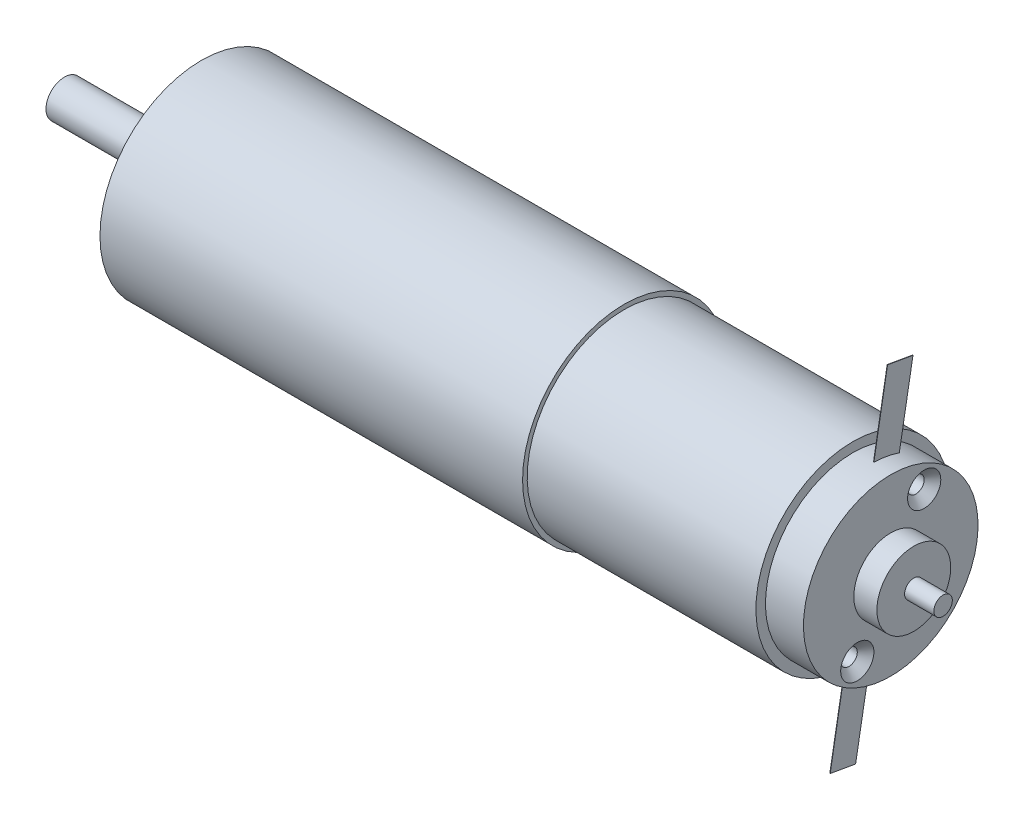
ISO-10303-21;
HEADER;
FILE_DESCRIPTION(('STEP AP214'),'2;1');
FILE_NAME('part.step','',(''),(''),'','','');
FILE_SCHEMA(('AUTOMOTIVE_DESIGN { 1 0 10303 214 1 1 1 1 }'));
ENDSEC;
DATA;
#1=APPLICATION_CONTEXT('core data for automotive mechanical design processes');
#2=APPLICATION_PROTOCOL_DEFINITION('international standard','automotive_design',2000,#1);
#3=PRODUCT_CONTEXT('',#1,'mechanical');
#4=PRODUCT('Part','Part','',(#3));
#5=PRODUCT_RELATED_PRODUCT_CATEGORY('part','',(#4));
#6=PRODUCT_DEFINITION_FORMATION('','',#4);
#7=PRODUCT_DEFINITION_CONTEXT('part definition',#1,'design');
#8=PRODUCT_DEFINITION('design','',#6,#7);
#9=PRODUCT_DEFINITION_SHAPE('','',#8);
#10=(LENGTH_UNIT() NAMED_UNIT(*) SI_UNIT(.MILLI.,.METRE.));
#11=(NAMED_UNIT(*) PLANE_ANGLE_UNIT() SI_UNIT($,.RADIAN.));
#12=(NAMED_UNIT(*) SI_UNIT($,.STERADIAN.) SOLID_ANGLE_UNIT());
#13=UNCERTAINTY_MEASURE_WITH_UNIT(LENGTH_MEASURE(1.E-05),#10,'distance_accuracy_value','');
#14=(GEOMETRIC_REPRESENTATION_CONTEXT(3) GLOBAL_UNCERTAINTY_ASSIGNED_CONTEXT((#13)) GLOBAL_UNIT_ASSIGNED_CONTEXT((#10,
#11,#12)) REPRESENTATION_CONTEXT('',''));
#15=CARTESIAN_POINT('',(0.,0.,0.));
#16=DIRECTION('',(0.,0.,1.));
#17=DIRECTION('',(1.,0.,0.));
#18=AXIS2_PLACEMENT_3D('',#15,#16,#17);
#19=CARTESIAN_POINT('',(44.8999999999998,0.,0.));
#20=DIRECTION('',(0.999999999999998,0.,0.));
#21=DIRECTION('',(0.,0.999999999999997,0.));
#22=AXIS2_PLACEMENT_3D('',#19,#20,#21);
#23=CYLINDRICAL_SURFACE('',#22,9.46149999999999);
#24=CARTESIAN_POINT('',(26.8251999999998,0.,0.));
#25=DIRECTION('',(-0.999999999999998,0.,0.));
#26=DIRECTION('',(0.,-0.999999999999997,0.));
#27=AXIS2_PLACEMENT_3D('',#24,#25,#26);
#28=CIRCLE('',#27,9.46149999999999);
#29=CARTESIAN_POINT('',(26.8251999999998,9.45829739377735,-0.246155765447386));
#30=VERTEX_POINT('',#29);
#31=CARTESIAN_POINT('',(26.8251999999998,8.97208249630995,-3.00361747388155));
#32=VERTEX_POINT('',#31);
#33=EDGE_CURVE('E285',#30,#32,#28,.T.);
#34=ORIENTED_EDGE('',*,*,#33,.F.);
#35=DIRECTION('',(0.999999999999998,0.,0.));
#36=VECTOR('',#35,1.);
#37=CARTESIAN_POINT('',(44.8999999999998,9.45829739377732,-0.246155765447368));
#38=LINE('',#37,#36);
#39=CARTESIAN_POINT('',(26.7851999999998,9.45829739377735,-0.246155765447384));
#40=VERTEX_POINT('',#39);
#41=EDGE_CURVE('E283',#40,#30,#38,.T.);
#42=ORIENTED_EDGE('',*,*,#41,.F.);
#43=CARTESIAN_POINT('',(26.7851999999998,0.,0.));
#44=DIRECTION('',(-0.999999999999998,0.,0.));
#45=DIRECTION('',(0.,-0.999999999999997,0.));
#46=AXIS2_PLACEMENT_3D('',#43,#44,#45);
#47=CIRCLE('',#46,9.46149999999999);
#48=CARTESIAN_POINT('',(26.7851999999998,8.97208249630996,-3.00361747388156));
#49=VERTEX_POINT('',#48);
#50=EDGE_CURVE('E278',#40,#49,#47,.T.);
#51=ORIENTED_EDGE('',*,*,#50,.T.);
#52=DIRECTION('',(0.999999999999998,0.,0.));
#53=VECTOR('',#52,1.);
#54=CARTESIAN_POINT('',(44.8999999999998,8.97208249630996,-3.00361747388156));
#55=LINE('',#54,#53);
#56=EDGE_CURVE('E281',#32,#49,#55,.F.);
#57=ORIENTED_EDGE('',*,*,#56,.F.);
#58=EDGE_LOOP('',(#34,#42,#51,#57));
#59=FACE_BOUND('',#58,.T.);
#60=CARTESIAN_POINT('',(28.8999999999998,0.,0.));
#61=DIRECTION('',(0.999999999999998,0.,0.));
#62=DIRECTION('',(0.,0.999999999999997,0.));
#63=AXIS2_PLACEMENT_3D('',#60,#61,#62);
#64=CIRCLE('',#63,9.46149999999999);
#65=CARTESIAN_POINT('',(28.8999999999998,9.46149999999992,0.));
#66=VERTEX_POINT('',#65);
#67=EDGE_CURVE('E236',#66,#66,#64,.T.);
#68=ORIENTED_EDGE('',*,*,#67,.F.);
#69=EDGE_LOOP('',(#68));
#70=FACE_BOUND('',#69,.T.);
#71=CARTESIAN_POINT('',(24.7851999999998,0.,0.));
#72=DIRECTION('',(0.999999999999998,0.,0.));
#73=DIRECTION('',(0.,0.999999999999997,0.));
#74=AXIS2_PLACEMENT_3D('',#71,#72,#73);
#75=CIRCLE('',#74,9.46149999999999);
#76=CARTESIAN_POINT('',(24.7851999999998,9.46149999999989,0.));
#77=VERTEX_POINT('',#76);
#78=EDGE_CURVE('E233',#77,#77,#75,.T.);
#79=ORIENTED_EDGE('',*,*,#78,.T.);
#80=EDGE_LOOP('',(#79));
#81=FACE_BOUND('',#80,.T.);
#82=CARTESIAN_POINT('',(26.8251999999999,0.,0.));
#83=DIRECTION('',(-0.999999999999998,0.,0.));
#84=DIRECTION('',(0.,-0.999999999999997,0.));
#85=AXIS2_PLACEMENT_3D('',#82,#83,#84);
#86=CIRCLE('',#85,9.46149999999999);
#87=CARTESIAN_POINT('',(26.8251999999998,-9.45829739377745,0.246155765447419));
#88=VERTEX_POINT('',#87);
#89=CARTESIAN_POINT('',(26.8251999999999,-8.97208249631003,3.00361747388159));
#90=VERTEX_POINT('',#89);
#91=EDGE_CURVE('E52',#88,#90,#86,.T.);
#92=ORIENTED_EDGE('',*,*,#91,.F.);
#93=DIRECTION('',(0.999999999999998,0.,0.));
#94=VECTOR('',#93,1.);
#95=CARTESIAN_POINT('',(44.8999999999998,-9.45829739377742,0.246155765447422));
#96=LINE('',#95,#94);
#97=CARTESIAN_POINT('',(26.7851999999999,-9.45829739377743,0.246155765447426));
#98=VERTEX_POINT('',#97);
#99=EDGE_CURVE('E290',#98,#88,#96,.T.);
#100=ORIENTED_EDGE('',*,*,#99,.F.);
#101=CARTESIAN_POINT('',(26.7851999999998,0.,0.));
#102=DIRECTION('',(-0.999999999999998,0.,0.));
#103=DIRECTION('',(0.,-0.999999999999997,0.));
#104=AXIS2_PLACEMENT_3D('',#101,#102,#103);
#105=CIRCLE('',#104,9.46149999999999);
#106=CARTESIAN_POINT('',(26.7851999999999,-8.97208249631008,3.0036174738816));
#107=VERTEX_POINT('',#106);
#108=EDGE_CURVE('E287',#98,#107,#105,.T.);
#109=ORIENTED_EDGE('',*,*,#108,.T.);
#110=DIRECTION('',(0.999999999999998,0.,0.));
#111=VECTOR('',#110,1.);
#112=CARTESIAN_POINT('',(44.8999999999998,-8.97208249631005,3.00361747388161));
#113=LINE('',#112,#111);
#114=EDGE_CURVE('E292',#90,#107,#113,.F.);
#115=ORIENTED_EDGE('',*,*,#114,.F.);
#116=EDGE_LOOP('',(#92,#100,#109,#115));
#117=FACE_BOUND('',#116,.T.);
#118=ADVANCED_FACE('F44',(#59,#70,#81,#117),#23,.T.);
#119=CARTESIAN_POINT('',(-1.38777878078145E-13,-10.5,0.));
#120=DIRECTION('',(-0.999999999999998,0.,0.));
#121=DIRECTION('',(0.,-0.999999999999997,0.));
#122=AXIS2_PLACEMENT_3D('',#119,#120,#121);
#123=PLANE('',#122);
#124=CARTESIAN_POINT('',(-1.11022302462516E-13,0.,0.));
#125=DIRECTION('',(0.999999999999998,0.,0.));
#126=DIRECTION('',(0.,0.999999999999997,0.));
#127=AXIS2_PLACEMENT_3D('',#124,#125,#126);
#128=CIRCLE('',#127,10.5);
#129=CARTESIAN_POINT('',(-1.11022302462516E-13,10.4999999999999,0.));
#130=VERTEX_POINT('',#129);
#131=EDGE_CURVE('E227',#130,#130,#128,.T.);
#132=ORIENTED_EDGE('',*,*,#131,.F.);
#133=EDGE_LOOP('',(#132));
#134=FACE_BOUND('',#133,.T.);
#135=CARTESIAN_POINT('',(-1.11022302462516E-13,0.,0.));
#136=DIRECTION('',(0.999999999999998,0.,0.));
#137=DIRECTION('',(0.,0.999999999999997,0.));
#138=AXIS2_PLACEMENT_3D('',#135,#136,#137);
#139=CIRCLE('',#138,11.);
#140=CARTESIAN_POINT('',(-1.11022302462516E-13,10.9999999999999,0.));
#141=VERTEX_POINT('',#140);
#142=EDGE_CURVE('E269',#141,#141,#139,.T.);
#143=ORIENTED_EDGE('',*,*,#142,.T.);
#144=EDGE_LOOP('',(#143));
#145=FACE_BOUND('',#144,.T.);
#146=ADVANCED_FACE('F46',(#134,#145),#123,.F.);
#147=CARTESIAN_POINT('',(44.8999999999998,0.,0.));
#148=DIRECTION('',(0.999999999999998,0.,0.));
#149=DIRECTION('',(0.,0.999999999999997,0.));
#150=AXIS2_PLACEMENT_3D('',#147,#148,#149);
#151=CYLINDRICAL_SURFACE('',#150,11.);
#152=CARTESIAN_POINT('',(-45.8000000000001,0.,0.));
#153=DIRECTION('',(0.999999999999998,0.,0.));
#154=DIRECTION('',(0.,0.999999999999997,0.));
#155=AXIS2_PLACEMENT_3D('',#152,#153,#154);
#156=CIRCLE('',#155,11.);
#157=CARTESIAN_POINT('',(-45.8000000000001,10.9999999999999,0.));
#158=VERTEX_POINT('',#157);
#159=EDGE_CURVE('E266',#158,#158,#156,.T.);
#160=CARTESIAN_POINT('',(-1.11022302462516E-13,10.9999999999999,0.));
#161=CARTESIAN_POINT('',(-0.477083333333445,10.9999999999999,0.));
#162=CARTESIAN_POINT('',(-0.954166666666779,10.9999999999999,0.));
#163=CARTESIAN_POINT('',(-1.90833333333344,10.9999999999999,0.));
#164=CARTESIAN_POINT('',(-2.38541666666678,10.9999999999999,0.));
#165=CARTESIAN_POINT('',(-3.33958333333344,10.9999999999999,0.));
#166=CARTESIAN_POINT('',(-3.81666666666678,10.9999999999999,0.));
#167=CARTESIAN_POINT('',(-4.77083333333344,10.9999999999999,0.));
#168=CARTESIAN_POINT('',(-5.24791666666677,10.9999999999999,0.));
#169=CARTESIAN_POINT('',(-6.20208333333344,10.9999999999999,0.));
#170=CARTESIAN_POINT('',(-6.67916666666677,10.9999999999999,0.));
#171=CARTESIAN_POINT('',(-7.63333333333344,10.9999999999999,0.));
#172=CARTESIAN_POINT('',(-8.11041666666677,10.9999999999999,0.));
#173=CARTESIAN_POINT('',(-9.06458333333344,10.9999999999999,0.));
#174=CARTESIAN_POINT('',(-9.54166666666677,10.9999999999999,0.));
#175=CARTESIAN_POINT('',(-10.4958333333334,10.9999999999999,0.));
#176=CARTESIAN_POINT('',(-10.9729166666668,10.9999999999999,0.));
#177=CARTESIAN_POINT('',(-11.9270833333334,10.9999999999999,0.));
#178=CARTESIAN_POINT('',(-12.4041666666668,10.9999999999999,0.));
#179=CARTESIAN_POINT('',(-13.3583333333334,10.9999999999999,0.));
#180=CARTESIAN_POINT('',(-13.8354166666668,10.9999999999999,0.));
#181=CARTESIAN_POINT('',(-14.7895833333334,10.9999999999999,0.));
#182=CARTESIAN_POINT('',(-15.2666666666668,10.9999999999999,0.));
#183=CARTESIAN_POINT('',(-16.2208333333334,10.9999999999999,0.));
#184=CARTESIAN_POINT('',(-16.6979166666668,10.9999999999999,0.));
#185=CARTESIAN_POINT('',(-17.6520833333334,10.9999999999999,0.));
#186=CARTESIAN_POINT('',(-18.1291666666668,10.9999999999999,0.));
#187=CARTESIAN_POINT('',(-19.0833333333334,10.9999999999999,0.));
#188=CARTESIAN_POINT('',(-19.5604166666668,10.9999999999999,0.));
#189=CARTESIAN_POINT('',(-20.5145833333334,10.9999999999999,0.));
#190=CARTESIAN_POINT('',(-20.9916666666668,10.9999999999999,0.));
#191=CARTESIAN_POINT('',(-21.9458333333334,10.9999999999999,0.));
#192=CARTESIAN_POINT('',(-22.4229166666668,10.9999999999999,0.));
#193=CARTESIAN_POINT('',(-23.3770833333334,10.9999999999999,0.));
#194=CARTESIAN_POINT('',(-23.8541666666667,10.9999999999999,0.));
#195=CARTESIAN_POINT('',(-24.8083333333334,10.9999999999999,0.));
#196=CARTESIAN_POINT('',(-25.2854166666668,10.9999999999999,0.));
#197=CARTESIAN_POINT('',(-26.2395833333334,10.9999999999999,0.));
#198=CARTESIAN_POINT('',(-26.7166666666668,10.9999999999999,0.));
#199=CARTESIAN_POINT('',(-27.6708333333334,10.9999999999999,0.));
#200=CARTESIAN_POINT('',(-28.1479166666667,10.9999999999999,0.));
#201=CARTESIAN_POINT('',(-29.1020833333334,10.9999999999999,0.));
#202=CARTESIAN_POINT('',(-29.5791666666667,10.9999999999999,0.));
#203=CARTESIAN_POINT('',(-30.5333333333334,10.9999999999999,0.));
#204=CARTESIAN_POINT('',(-31.0104166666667,10.9999999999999,0.));
#205=CARTESIAN_POINT('',(-31.9645833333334,10.9999999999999,0.));
#206=CARTESIAN_POINT('',(-32.4416666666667,10.9999999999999,0.));
#207=CARTESIAN_POINT('',(-33.3958333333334,10.9999999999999,0.));
#208=CARTESIAN_POINT('',(-33.8729166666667,10.9999999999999,0.));
#209=CARTESIAN_POINT('',(-34.8270833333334,10.9999999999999,0.));
#210=CARTESIAN_POINT('',(-35.3041666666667,10.9999999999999,0.));
#211=CARTESIAN_POINT('',(-36.2583333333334,10.9999999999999,0.));
#212=CARTESIAN_POINT('',(-36.7354166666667,10.9999999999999,0.));
#213=CARTESIAN_POINT('',(-37.6895833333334,10.9999999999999,0.));
#214=CARTESIAN_POINT('',(-38.1666666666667,10.9999999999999,0.));
#215=CARTESIAN_POINT('',(-39.1208333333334,10.9999999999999,0.));
#216=CARTESIAN_POINT('',(-39.5979166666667,10.9999999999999,0.));
#217=CARTESIAN_POINT('',(-40.5520833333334,10.9999999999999,0.));
#218=CARTESIAN_POINT('',(-41.0291666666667,10.9999999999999,0.));
#219=CARTESIAN_POINT('',(-41.9833333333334,10.9999999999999,0.));
#220=CARTESIAN_POINT('',(-42.4604166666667,10.9999999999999,0.));
#221=CARTESIAN_POINT('',(-43.4145833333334,10.9999999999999,0.));
#222=CARTESIAN_POINT('',(-43.8916666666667,10.9999999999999,0.));
#223=CARTESIAN_POINT('',(-44.8458333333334,10.9999999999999,0.));
#224=CARTESIAN_POINT('',(-45.3229166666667,10.9999999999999,0.));
#225=CARTESIAN_POINT('',(-45.8000000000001,10.9999999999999,0.));
#226=B_SPLINE_CURVE_WITH_KNOTS('',3,(#160,#161,#162,#163,#164,#165,#166,#167,#168,#169,#170,
#171,#172,#173,#174,#175,#176,#177,#178,#179,#180,#181,#182,#183,#184,#185,#186,#187,#188,#189,
#190,#191,#192,#193,#194,#195,#196,#197,#198,#199,#200,#201,#202,#203,#204,#205,#206,#207,#208,
#209,#210,#211,#212,#213,#214,#215,#216,#217,#218,#219,#220,#221,#222,#223,#224,#225),
.UNSPECIFIED.,.F.,.F.,(4,2,2,2,2,2,2,2,2,2,2,2,2,2,2,2,2,2,2,2,2,2,2,2,2,2,2,2,2,2,2,2,4),(0.,
1.43125,2.8625,4.29375,5.72499999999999,7.15625,8.58749999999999,10.01875,11.45,12.88125,
14.3125,15.74375,17.175,18.60625,20.0375,21.46875,22.9,24.33125,25.7625,27.19375,28.625,
30.05625,31.4875,32.91875,34.35,35.78125,37.2125,38.64375,40.075,41.50625,42.9375,44.36875,
45.8),.UNSPECIFIED.);
#227=EDGE_CURVE('BSEAM331',#141,#158,#226,.T.);
#228=ORIENTED_EDGE('',*,*,#142,.F.);
#229=ORIENTED_EDGE('',*,*,#159,.T.);
#230=ORIENTED_EDGE('',*,*,#227,.T.);
#231=ORIENTED_EDGE('',*,*,#227,.F.);
#232=EDGE_LOOP('',(#228,#230,#229,#231));
#233=FACE_BOUND('',#232,.T.);
#234=ADVANCED_FACE('F331',(#233),#151,.T.);
#235=CARTESIAN_POINT('',(-45.8,-11.,0.));
#236=DIRECTION('',(0.999999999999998,0.,0.));
#237=DIRECTION('',(0.,0.999999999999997,0.));
#238=AXIS2_PLACEMENT_3D('',#235,#236,#237);
#239=PLANE('',#238);
#240=CARTESIAN_POINT('',(-45.8000000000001,6.99999999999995,0.));
#241=DIRECTION('',(-0.999999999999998,0.,0.));
#242=DIRECTION('',(0.,0.,0.999999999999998));
#243=AXIS2_PLACEMENT_3D('',#240,#241,#242);
#244=CIRCLE('',#243,1.025);
#245=CARTESIAN_POINT('',(-45.8000000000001,6.99999999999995,1.02500000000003));
#246=VERTEX_POINT('',#245);
#247=EDGE_CURVE('E160',#246,#246,#244,.T.);
#248=ORIENTED_EDGE('',*,*,#247,.F.);
#249=EDGE_LOOP('',(#248));
#250=FACE_BOUND('',#249,.T.);
#251=CARTESIAN_POINT('',(-45.8,-3.50000000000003,6.06217782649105));
#252=DIRECTION('',(-0.999999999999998,0.,0.));
#253=DIRECTION('',(0.,0.,0.999999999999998));
#254=AXIS2_PLACEMENT_3D('',#251,#252,#253);
#255=CIRCLE('',#254,1.025);
#256=CARTESIAN_POINT('',(-45.8,-3.50000000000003,7.08717782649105));
#257=VERTEX_POINT('',#256);
#258=EDGE_CURVE('E166',#257,#257,#255,.T.);
#259=ORIENTED_EDGE('',*,*,#258,.F.);
#260=EDGE_LOOP('',(#259));
#261=FACE_BOUND('',#260,.T.);
#262=CARTESIAN_POINT('',(-45.8,-3.50000000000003,-6.06217782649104));
#263=DIRECTION('',(-0.999999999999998,0.,0.));
#264=DIRECTION('',(0.,0.,0.999999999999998));
#265=AXIS2_PLACEMENT_3D('',#262,#263,#264);
#266=CIRCLE('',#265,1.025);
#267=CARTESIAN_POINT('',(-45.8,-3.50000000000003,-5.03717782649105));
#268=VERTEX_POINT('',#267);
#269=EDGE_CURVE('E172',#268,#268,#266,.T.);
#270=ORIENTED_EDGE('',*,*,#269,.F.);
#271=EDGE_LOOP('',(#270));
#272=FACE_BOUND('',#271,.T.);
#273=ORIENTED_EDGE('',*,*,#159,.F.);
#274=EDGE_LOOP('',(#273));
#275=FACE_BOUND('',#274,.T.);
#276=CARTESIAN_POINT('',(-45.8000000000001,0.,0.));
#277=DIRECTION('',(0.999999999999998,0.,0.));
#278=DIRECTION('',(0.,0.999999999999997,0.));
#279=AXIS2_PLACEMENT_3D('',#276,#277,#278);
#280=CIRCLE('',#279,5.);
#281=CARTESIAN_POINT('',(-45.8000000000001,4.99999999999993,0.));
#282=VERTEX_POINT('',#281);
#283=EDGE_CURVE('E263',#282,#282,#280,.T.);
#284=ORIENTED_EDGE('',*,*,#283,.T.);
#285=EDGE_LOOP('',(#284));
#286=FACE_BOUND('',#285,.T.);
#287=ADVANCED_FACE('F378',(#250,#261,#272,#275,#286),#239,.F.);
#288=CARTESIAN_POINT('',(44.8999999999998,0.,0.));
#289=DIRECTION('',(0.999999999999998,0.,0.));
#290=DIRECTION('',(0.,0.999999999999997,0.));
#291=AXIS2_PLACEMENT_3D('',#288,#289,#290);
#292=CYLINDRICAL_SURFACE('',#291,5.);
#293=CARTESIAN_POINT('',(-47.1500000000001,0.,0.));
#294=DIRECTION('',(0.999999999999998,0.,0.));
#295=DIRECTION('',(0.,0.999999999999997,0.));
#296=AXIS2_PLACEMENT_3D('',#293,#294,#295);
#297=CIRCLE('',#296,5.);
#298=CARTESIAN_POINT('',(-47.1500000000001,4.99999999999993,0.));
#299=VERTEX_POINT('',#298);
#300=EDGE_CURVE('E260',#299,#299,#297,.T.);
#301=CARTESIAN_POINT('',(-45.8000000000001,4.99999999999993,0.));
#302=CARTESIAN_POINT('',(-45.8140625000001,4.99999999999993,0.));
#303=CARTESIAN_POINT('',(-45.8281250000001,4.99999999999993,0.));
#304=CARTESIAN_POINT('',(-45.8562500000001,4.99999999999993,0.));
#305=CARTESIAN_POINT('',(-45.8703125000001,4.99999999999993,0.));
#306=CARTESIAN_POINT('',(-45.8984375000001,4.99999999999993,0.));
#307=CARTESIAN_POINT('',(-45.9125000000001,4.99999999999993,0.));
#308=CARTESIAN_POINT('',(-45.9406250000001,4.99999999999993,0.));
#309=CARTESIAN_POINT('',(-45.9546875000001,4.99999999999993,0.));
#310=CARTESIAN_POINT('',(-45.9828125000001,4.99999999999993,0.));
#311=CARTESIAN_POINT('',(-45.9968750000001,4.99999999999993,0.));
#312=CARTESIAN_POINT('',(-46.0250000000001,4.99999999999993,0.));
#313=CARTESIAN_POINT('',(-46.0390625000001,4.99999999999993,0.));
#314=CARTESIAN_POINT('',(-46.0671875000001,4.99999999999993,0.));
#315=CARTESIAN_POINT('',(-46.0812500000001,4.99999999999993,0.));
#316=CARTESIAN_POINT('',(-46.1093750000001,4.99999999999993,0.));
#317=CARTESIAN_POINT('',(-46.1234375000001,4.99999999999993,0.));
#318=CARTESIAN_POINT('',(-46.1515625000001,4.99999999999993,0.));
#319=CARTESIAN_POINT('',(-46.1656250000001,4.99999999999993,0.));
#320=CARTESIAN_POINT('',(-46.1937500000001,4.99999999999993,0.));
#321=CARTESIAN_POINT('',(-46.2078125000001,4.99999999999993,0.));
#322=CARTESIAN_POINT('',(-46.2359375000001,4.99999999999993,0.));
#323=CARTESIAN_POINT('',(-46.2500000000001,4.99999999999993,0.));
#324=CARTESIAN_POINT('',(-46.2781250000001,4.99999999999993,0.));
#325=CARTESIAN_POINT('',(-46.2921875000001,4.99999999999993,0.));
#326=CARTESIAN_POINT('',(-46.3203125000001,4.99999999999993,0.));
#327=CARTESIAN_POINT('',(-46.3343750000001,4.99999999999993,0.));
#328=CARTESIAN_POINT('',(-46.3625000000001,4.99999999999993,0.));
#329=CARTESIAN_POINT('',(-46.3765625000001,4.99999999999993,0.));
#330=CARTESIAN_POINT('',(-46.4046875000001,4.99999999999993,0.));
#331=CARTESIAN_POINT('',(-46.4187500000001,4.99999999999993,0.));
#332=CARTESIAN_POINT('',(-46.4468750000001,4.99999999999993,0.));
#333=CARTESIAN_POINT('',(-46.4609375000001,4.99999999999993,0.));
#334=CARTESIAN_POINT('',(-46.4890625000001,4.99999999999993,0.));
#335=CARTESIAN_POINT('',(-46.5031250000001,4.99999999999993,0.));
#336=CARTESIAN_POINT('',(-46.5312500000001,4.99999999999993,0.));
#337=CARTESIAN_POINT('',(-46.5453125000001,4.99999999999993,0.));
#338=CARTESIAN_POINT('',(-46.5734375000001,4.99999999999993,0.));
#339=CARTESIAN_POINT('',(-46.5875000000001,4.99999999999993,0.));
#340=CARTESIAN_POINT('',(-46.6156250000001,4.99999999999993,0.));
#341=CARTESIAN_POINT('',(-46.6296875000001,4.99999999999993,0.));
#342=CARTESIAN_POINT('',(-46.6578125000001,4.99999999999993,0.));
#343=CARTESIAN_POINT('',(-46.6718750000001,4.99999999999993,0.));
#344=CARTESIAN_POINT('',(-46.7000000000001,4.99999999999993,0.));
#345=CARTESIAN_POINT('',(-46.7140625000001,4.99999999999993,0.));
#346=CARTESIAN_POINT('',(-46.7421875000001,4.99999999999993,0.));
#347=CARTESIAN_POINT('',(-46.7562500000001,4.99999999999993,0.));
#348=CARTESIAN_POINT('',(-46.7843750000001,4.99999999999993,0.));
#349=CARTESIAN_POINT('',(-46.7984375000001,4.99999999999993,0.));
#350=CARTESIAN_POINT('',(-46.8265625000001,4.99999999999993,0.));
#351=CARTESIAN_POINT('',(-46.8406250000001,4.99999999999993,0.));
#352=CARTESIAN_POINT('',(-46.8687500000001,4.99999999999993,0.));
#353=CARTESIAN_POINT('',(-46.8828125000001,4.99999999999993,0.));
#354=CARTESIAN_POINT('',(-46.9109375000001,4.99999999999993,0.));
#355=CARTESIAN_POINT('',(-46.9250000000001,4.99999999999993,0.));
#356=CARTESIAN_POINT('',(-46.9531250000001,4.99999999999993,0.));
#357=CARTESIAN_POINT('',(-46.9671875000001,4.99999999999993,0.));
#358=CARTESIAN_POINT('',(-46.9953125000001,4.99999999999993,0.));
#359=CARTESIAN_POINT('',(-47.0093750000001,4.99999999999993,0.));
#360=CARTESIAN_POINT('',(-47.0375000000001,4.99999999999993,0.));
#361=CARTESIAN_POINT('',(-47.0515625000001,4.99999999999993,0.));
#362=CARTESIAN_POINT('',(-47.0796875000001,4.99999999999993,0.));
#363=CARTESIAN_POINT('',(-47.0937500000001,4.99999999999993,0.));
#364=CARTESIAN_POINT('',(-47.1218750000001,4.99999999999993,0.));
#365=CARTESIAN_POINT('',(-47.1359375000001,4.99999999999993,0.));
#366=CARTESIAN_POINT('',(-47.1500000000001,4.99999999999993,0.));
#367=B_SPLINE_CURVE_WITH_KNOTS('',3,(#301,#302,#303,#304,#305,#306,#307,#308,#309,#310,#311,
#312,#313,#314,#315,#316,#317,#318,#319,#320,#321,#322,#323,#324,#325,#326,#327,#328,#329,#330,
#331,#332,#333,#334,#335,#336,#337,#338,#339,#340,#341,#342,#343,#344,#345,#346,#347,#348,#349,
#350,#351,#352,#353,#354,#355,#356,#357,#358,#359,#360,#361,#362,#363,#364,#365,#366),
.UNSPECIFIED.,.F.,.F.,(4,2,2,2,2,2,2,2,2,2,2,2,2,2,2,2,2,2,2,2,2,2,2,2,2,2,2,2,2,2,2,2,4),(0.,
0.0421874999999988,0.0843749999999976,0.126562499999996,0.168749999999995,0.210937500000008,
0.253125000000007,0.295312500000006,0.337500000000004,0.379687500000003,0.421875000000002,
0.464062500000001,0.506250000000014,0.548437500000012,0.590625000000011,0.63281250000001,
0.675000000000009,0.717187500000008,0.759375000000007,0.801562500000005,0.843750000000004,
0.885937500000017,0.928125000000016,0.970312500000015,1.01250000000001,1.05468750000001,
1.09687500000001,1.13906250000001,1.18125000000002,1.22343750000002,1.26562500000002,
1.30781250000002,1.35000000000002),.UNSPECIFIED.);
#368=EDGE_CURVE('BSEAM374',#282,#299,#367,.T.);
#369=ORIENTED_EDGE('',*,*,#283,.F.);
#370=ORIENTED_EDGE('',*,*,#300,.T.);
#371=ORIENTED_EDGE('',*,*,#368,.T.);
#372=ORIENTED_EDGE('',*,*,#368,.F.);
#373=EDGE_LOOP('',(#369,#371,#370,#372));
#374=FACE_BOUND('',#373,.T.);
#375=ADVANCED_FACE('F374',(#374),#292,.T.);
#376=CARTESIAN_POINT('',(-47.15,-5.00000000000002,0.));
#377=DIRECTION('',(0.999999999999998,0.,0.));
#378=DIRECTION('',(0.,0.999999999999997,0.));
#379=AXIS2_PLACEMENT_3D('',#376,#377,#378);
#380=PLANE('',#379);
#381=ORIENTED_EDGE('',*,*,#300,.F.);
#382=EDGE_LOOP('',(#381));
#383=FACE_BOUND('',#382,.T.);
#384=CARTESIAN_POINT('',(-47.1500000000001,0.,0.));
#385=DIRECTION('',(0.999999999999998,0.,0.));
#386=DIRECTION('',(0.,0.999999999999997,0.));
#387=AXIS2_PLACEMENT_3D('',#384,#385,#386);
#388=CIRCLE('',#387,3.4925);
#389=CARTESIAN_POINT('',(-47.1500000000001,3.49249999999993,0.));
#390=VERTEX_POINT('',#389);
#391=EDGE_CURVE('E257',#390,#390,#388,.T.);
#392=ORIENTED_EDGE('',*,*,#391,.T.);
#393=EDGE_LOOP('',(#392));
#394=FACE_BOUND('',#393,.T.);
#395=ADVANCED_FACE('F370',(#383,#394),#380,.F.);
#396=CARTESIAN_POINT('',(44.8999999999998,0.,0.));
#397=DIRECTION('',(0.999999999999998,0.,0.));
#398=DIRECTION('',(0.,0.999999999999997,0.));
#399=AXIS2_PLACEMENT_3D('',#396,#397,#398);
#400=CYLINDRICAL_SURFACE('',#399,3.4925);
#401=CARTESIAN_POINT('',(-48.9500000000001,0.,0.));
#402=DIRECTION('',(0.999999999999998,0.,0.));
#403=DIRECTION('',(0.,0.999999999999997,0.));
#404=AXIS2_PLACEMENT_3D('',#401,#402,#403);
#405=CIRCLE('',#404,3.4925);
#406=CARTESIAN_POINT('',(-48.9500000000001,3.49249999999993,0.));
#407=VERTEX_POINT('',#406);
#408=EDGE_CURVE('E254',#407,#407,#405,.T.);
#409=CARTESIAN_POINT('',(-47.1500000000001,3.49249999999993,0.));
#410=CARTESIAN_POINT('',(-47.1687500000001,3.49249999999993,0.));
#411=CARTESIAN_POINT('',(-47.1875000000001,3.49249999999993,0.));
#412=CARTESIAN_POINT('',(-47.2250000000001,3.49249999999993,0.));
#413=CARTESIAN_POINT('',(-47.2437500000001,3.49249999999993,0.));
#414=CARTESIAN_POINT('',(-47.2812500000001,3.49249999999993,0.));
#415=CARTESIAN_POINT('',(-47.3000000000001,3.49249999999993,0.));
#416=CARTESIAN_POINT('',(-47.3375000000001,3.49249999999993,0.));
#417=CARTESIAN_POINT('',(-47.3562500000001,3.49249999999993,0.));
#418=CARTESIAN_POINT('',(-47.3937500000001,3.49249999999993,0.));
#419=CARTESIAN_POINT('',(-47.4125000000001,3.49249999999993,0.));
#420=CARTESIAN_POINT('',(-47.4500000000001,3.49249999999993,0.));
#421=CARTESIAN_POINT('',(-47.4687500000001,3.49249999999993,0.));
#422=CARTESIAN_POINT('',(-47.5062500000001,3.49249999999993,0.));
#423=CARTESIAN_POINT('',(-47.5250000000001,3.49249999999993,0.));
#424=CARTESIAN_POINT('',(-47.5625000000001,3.49249999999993,0.));
#425=CARTESIAN_POINT('',(-47.5812500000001,3.49249999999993,0.));
#426=CARTESIAN_POINT('',(-47.6187500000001,3.49249999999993,0.));
#427=CARTESIAN_POINT('',(-47.6375000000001,3.49249999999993,0.));
#428=CARTESIAN_POINT('',(-47.6750000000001,3.49249999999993,0.));
#429=CARTESIAN_POINT('',(-47.6937500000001,3.49249999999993,0.));
#430=CARTESIAN_POINT('',(-47.7312500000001,3.49249999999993,0.));
#431=CARTESIAN_POINT('',(-47.7500000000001,3.49249999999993,0.));
#432=CARTESIAN_POINT('',(-47.7875000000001,3.49249999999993,0.));
#433=CARTESIAN_POINT('',(-47.8062500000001,3.49249999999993,0.));
#434=CARTESIAN_POINT('',(-47.8437500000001,3.49249999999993,0.));
#435=CARTESIAN_POINT('',(-47.8625000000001,3.49249999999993,0.));
#436=CARTESIAN_POINT('',(-47.9000000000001,3.49249999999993,0.));
#437=CARTESIAN_POINT('',(-47.9187500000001,3.49249999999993,0.));
#438=CARTESIAN_POINT('',(-47.9562500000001,3.49249999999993,0.));
#439=CARTESIAN_POINT('',(-47.9750000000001,3.49249999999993,0.));
#440=CARTESIAN_POINT('',(-48.0125000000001,3.49249999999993,0.));
#441=CARTESIAN_POINT('',(-48.0312500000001,3.49249999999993,0.));
#442=CARTESIAN_POINT('',(-48.0687500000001,3.49249999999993,0.));
#443=CARTESIAN_POINT('',(-48.0875000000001,3.49249999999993,0.));
#444=CARTESIAN_POINT('',(-48.1250000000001,3.49249999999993,0.));
#445=CARTESIAN_POINT('',(-48.1437500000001,3.49249999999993,0.));
#446=CARTESIAN_POINT('',(-48.1812500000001,3.49249999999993,0.));
#447=CARTESIAN_POINT('',(-48.2000000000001,3.49249999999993,0.));
#448=CARTESIAN_POINT('',(-48.2375000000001,3.49249999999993,0.));
#449=CARTESIAN_POINT('',(-48.2562500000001,3.49249999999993,0.));
#450=CARTESIAN_POINT('',(-48.2937500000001,3.49249999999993,0.));
#451=CARTESIAN_POINT('',(-48.3125000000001,3.49249999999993,0.));
#452=CARTESIAN_POINT('',(-48.3500000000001,3.49249999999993,0.));
#453=CARTESIAN_POINT('',(-48.3687500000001,3.49249999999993,0.));
#454=CARTESIAN_POINT('',(-48.4062500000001,3.49249999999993,0.));
#455=CARTESIAN_POINT('',(-48.4250000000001,3.49249999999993,0.));
#456=CARTESIAN_POINT('',(-48.4625000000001,3.49249999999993,0.));
#457=CARTESIAN_POINT('',(-48.4812500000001,3.49249999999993,0.));
#458=CARTESIAN_POINT('',(-48.5187500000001,3.49249999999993,0.));
#459=CARTESIAN_POINT('',(-48.5375000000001,3.49249999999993,0.));
#460=CARTESIAN_POINT('',(-48.5750000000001,3.49249999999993,0.));
#461=CARTESIAN_POINT('',(-48.5937500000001,3.49249999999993,0.));
#462=CARTESIAN_POINT('',(-48.6312500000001,3.49249999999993,0.));
#463=CARTESIAN_POINT('',(-48.6500000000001,3.49249999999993,0.));
#464=CARTESIAN_POINT('',(-48.6875000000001,3.49249999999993,0.));
#465=CARTESIAN_POINT('',(-48.7062500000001,3.49249999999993,0.));
#466=CARTESIAN_POINT('',(-48.7437500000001,3.49249999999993,0.));
#467=CARTESIAN_POINT('',(-48.7625000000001,3.49249999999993,0.));
#468=CARTESIAN_POINT('',(-48.8000000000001,3.49249999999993,0.));
#469=CARTESIAN_POINT('',(-48.8187500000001,3.49249999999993,0.));
#470=CARTESIAN_POINT('',(-48.8562500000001,3.49249999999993,0.));
#471=CARTESIAN_POINT('',(-48.8750000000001,3.49249999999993,0.));
#472=CARTESIAN_POINT('',(-48.9125000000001,3.49249999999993,0.));
#473=CARTESIAN_POINT('',(-48.9312500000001,3.49249999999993,0.));
#474=CARTESIAN_POINT('',(-48.9500000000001,3.49249999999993,0.));
#475=B_SPLINE_CURVE_WITH_KNOTS('',3,(#409,#410,#411,#412,#413,#414,#415,#416,#417,#418,#419,
#420,#421,#422,#423,#424,#425,#426,#427,#428,#429,#430,#431,#432,#433,#434,#435,#436,#437,#438,
#439,#440,#441,#442,#443,#444,#445,#446,#447,#448,#449,#450,#451,#452,#453,#454,#455,#456,#457,
#458,#459,#460,#461,#462,#463,#464,#465,#466,#467,#468,#469,#470,#471,#472,#473,#474),
.UNSPECIFIED.,.F.,.F.,(4,2,2,2,2,2,2,2,2,2,2,2,2,2,2,2,2,2,2,2,2,2,2,2,2,2,2,2,2,2,2,2,4),(0.,
0.0562500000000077,0.112500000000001,0.168750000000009,0.225000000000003,0.281250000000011,
0.337500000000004,0.393750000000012,0.450000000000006,0.506250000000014,0.562500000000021,
0.618750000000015,0.675000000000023,0.731250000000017,0.787500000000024,0.843750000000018,
0.900000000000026,0.956250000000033,1.01250000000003,1.06875000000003,1.12500000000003,
1.18125000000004,1.23750000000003,1.29375000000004,1.35000000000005,1.40625000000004,
1.46250000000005,1.51875000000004,1.57500000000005,1.63125000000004,1.68750000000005,
1.74375000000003,1.80000000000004),.UNSPECIFIED.);
#476=EDGE_CURVE('BSEAM366',#390,#407,#475,.T.);
#477=ORIENTED_EDGE('',*,*,#391,.F.);
#478=ORIENTED_EDGE('',*,*,#408,.T.);
#479=ORIENTED_EDGE('',*,*,#476,.T.);
#480=ORIENTED_EDGE('',*,*,#476,.F.);
#481=EDGE_LOOP('',(#477,#479,#478,#480));
#482=FACE_BOUND('',#481,.T.);
#483=ADVANCED_FACE('F366',(#482),#400,.T.);
#484=CARTESIAN_POINT('',(-48.95,-3.49250000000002,0.));
#485=DIRECTION('',(0.999999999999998,0.,0.));
#486=DIRECTION('',(0.,0.999999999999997,0.));
#487=AXIS2_PLACEMENT_3D('',#484,#485,#486);
#488=PLANE('',#487);
#489=ORIENTED_EDGE('',*,*,#408,.F.);
#490=EDGE_LOOP('',(#489));
#491=FACE_BOUND('',#490,.T.);
#492=CARTESIAN_POINT('',(-48.9500000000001,0.,0.));
#493=DIRECTION('',(0.999999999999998,0.,0.));
#494=DIRECTION('',(0.,0.999999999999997,0.));
#495=AXIS2_PLACEMENT_3D('',#492,#493,#494);
#496=CIRCLE('',#495,2.);
#497=CARTESIAN_POINT('',(-48.9500000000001,1.99999999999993,0.));
#498=VERTEX_POINT('',#497);
#499=EDGE_CURVE('E251',#498,#498,#496,.T.);
#500=ORIENTED_EDGE('',*,*,#499,.T.);
#501=EDGE_LOOP('',(#500));
#502=FACE_BOUND('',#501,.T.);
#503=ADVANCED_FACE('F362',(#491,#502),#488,.F.);
#504=CARTESIAN_POINT('',(44.8999999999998,0.,0.));
#505=DIRECTION('',(0.999999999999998,0.,0.));
#506=DIRECTION('',(0.,0.999999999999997,0.));
#507=AXIS2_PLACEMENT_3D('',#504,#505,#506);
#508=CYLINDRICAL_SURFACE('',#507,2.);
#509=ORIENTED_EDGE('',*,*,#499,.F.);
#510=EDGE_LOOP('',(#509));
#511=FACE_BOUND('',#510,.T.);
#512=CARTESIAN_POINT('',(-60.65,0.,0.));
#513=DIRECTION('',(0.999999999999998,0.,0.));
#514=DIRECTION('',(0.,0.999999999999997,0.));
#515=AXIS2_PLACEMENT_3D('',#512,#513,#514);
#516=CIRCLE('',#515,2.);
#517=CARTESIAN_POINT('',(-60.65,1.32287565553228,-1.49999999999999));
#518=VERTEX_POINT('',#517);
#519=CARTESIAN_POINT('',(-60.65,-1.32287565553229,-1.49999999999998));
#520=VERTEX_POINT('',#519);
#521=EDGE_CURVE('E248',#518,#520,#516,.T.);
#522=ORIENTED_EDGE('',*,*,#521,.T.);
#523=DIRECTION('',(0.999999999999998,0.,0.));
#524=VECTOR('',#523,1.);
#525=CARTESIAN_POINT('',(44.8999999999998,-1.32287565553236,-1.49999999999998));
#526=LINE('',#525,#524);
#527=CARTESIAN_POINT('',(-51.3499999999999,-1.32287565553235,-1.49999999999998));
#528=VERTEX_POINT('',#527);
#529=EDGE_CURVE('E224',#520,#528,#526,.T.);
#530=ORIENTED_EDGE('',*,*,#529,.T.);
#531=CARTESIAN_POINT('',(-51.3500000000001,0.,0.));
#532=DIRECTION('',(0.999999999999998,0.,0.));
#533=DIRECTION('',(0.,0.,-0.999999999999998));
#534=AXIS2_PLACEMENT_3D('',#531,#532,#533);
#535=CIRCLE('',#534,2.);
#536=CARTESIAN_POINT('',(-51.35,1.32287565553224,-1.49999999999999));
#537=VERTEX_POINT('',#536);
#538=EDGE_CURVE('E275',#528,#537,#535,.T.);
#539=ORIENTED_EDGE('',*,*,#538,.T.);
#540=DIRECTION('',(0.999999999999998,0.,0.));
#541=VECTOR('',#540,1.);
#542=CARTESIAN_POINT('',(44.8999999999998,1.32287565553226,-1.49999999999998));
#543=LINE('',#542,#541);
#544=EDGE_CURVE('E221',#537,#518,#543,.F.);
#545=ORIENTED_EDGE('',*,*,#544,.T.);
#546=EDGE_LOOP('',(#522,#530,#539,#545));
#547=FACE_BOUND('',#546,.T.);
#548=ADVANCED_FACE('F358',(#511,#547),#508,.T.);
#549=CARTESIAN_POINT('',(-60.65,-2.00000000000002,0.));
#550=DIRECTION('',(0.999999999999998,0.,0.));
#551=DIRECTION('',(0.,0.999999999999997,0.));
#552=AXIS2_PLACEMENT_3D('',#549,#550,#551);
#553=PLANE('',#552);
#554=ORIENTED_EDGE('',*,*,#521,.F.);
#555=DIRECTION('',(0.,-0.999999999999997,0.));
#556=VECTOR('',#555,1.);
#557=CARTESIAN_POINT('',(-60.65,-2.00000000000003,-1.49999999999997));
#558=LINE('',#557,#556);
#559=EDGE_CURVE('E272',#518,#520,#558,.T.);
#560=ORIENTED_EDGE('',*,*,#559,.T.);
#561=EDGE_LOOP('',(#554,#560));
#562=FACE_BOUND('',#561,.T.);
#563=ADVANCED_FACE('F354',(#562),#553,.F.);
#564=CARTESIAN_POINT('',(44.8999999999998,0.,0.));
#565=DIRECTION('',(0.999999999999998,0.,0.));
#566=DIRECTION('',(0.,0.999999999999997,0.));
#567=AXIS2_PLACEMENT_3D('',#564,#565,#566);
#568=CYLINDRICAL_SURFACE('',#567,0.99999999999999);
#569=CARTESIAN_POINT('',(34.5749999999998,0.,0.));
#570=DIRECTION('',(-0.999999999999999,0.,0.));
#571=DIRECTION('',(0.,0.,0.999999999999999));
#572=AXIS2_PLACEMENT_3D('',#569,#570,#571);
#573=CIRCLE('',#572,0.99999999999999);
#574=CARTESIAN_POINT('',(34.5749999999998,0.999999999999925,0.));
#575=VERTEX_POINT('',#574);
#576=EDGE_CURVE('E11',#575,#575,#573,.T.);
#577=CARTESIAN_POINT('',(31.3999999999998,0.,0.));
#578=DIRECTION('',(0.999999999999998,0.,0.));
#579=DIRECTION('',(0.,0.999999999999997,0.));
#580=AXIS2_PLACEMENT_3D('',#577,#578,#579);
#581=CIRCLE('',#580,0.99999999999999);
#582=CARTESIAN_POINT('',(31.3999999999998,0.999999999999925,0.));
#583=VERTEX_POINT('',#582);
#584=EDGE_CURVE('E245',#583,#583,#581,.T.);
#585=CARTESIAN_POINT('',(34.5749999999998,0.999999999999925,0.));
#586=CARTESIAN_POINT('',(34.5419270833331,0.999999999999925,0.));
#587=CARTESIAN_POINT('',(34.5088541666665,0.999999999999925,0.));
#588=CARTESIAN_POINT('',(34.4427083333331,0.999999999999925,0.));
#589=CARTESIAN_POINT('',(34.4096354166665,0.999999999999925,0.));
#590=CARTESIAN_POINT('',(34.3434895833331,0.999999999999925,0.));
#591=CARTESIAN_POINT('',(34.3104166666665,0.999999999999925,0.));
#592=CARTESIAN_POINT('',(34.2442708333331,0.999999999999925,0.));
#593=CARTESIAN_POINT('',(34.2111979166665,0.999999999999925,0.));
#594=CARTESIAN_POINT('',(34.1450520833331,0.999999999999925,0.));
#595=CARTESIAN_POINT('',(34.1119791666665,0.999999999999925,0.));
#596=CARTESIAN_POINT('',(34.0458333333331,0.999999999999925,0.));
#597=CARTESIAN_POINT('',(34.0127604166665,0.999999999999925,0.));
#598=CARTESIAN_POINT('',(33.9466145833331,0.999999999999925,0.));
#599=CARTESIAN_POINT('',(33.9135416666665,0.999999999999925,0.));
#600=CARTESIAN_POINT('',(33.8473958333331,0.999999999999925,0.));
#601=CARTESIAN_POINT('',(33.8143229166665,0.999999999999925,0.));
#602=CARTESIAN_POINT('',(33.7481770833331,0.999999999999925,0.));
#603=CARTESIAN_POINT('',(33.7151041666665,0.999999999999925,0.));
#604=CARTESIAN_POINT('',(33.6489583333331,0.999999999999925,0.));
#605=CARTESIAN_POINT('',(33.6158854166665,0.999999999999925,0.));
#606=CARTESIAN_POINT('',(33.5497395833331,0.999999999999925,0.));
#607=CARTESIAN_POINT('',(33.5166666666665,0.999999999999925,0.));
#608=CARTESIAN_POINT('',(33.4505208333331,0.999999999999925,0.));
#609=CARTESIAN_POINT('',(33.4174479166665,0.999999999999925,0.));
#610=CARTESIAN_POINT('',(33.3513020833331,0.999999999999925,0.));
#611=CARTESIAN_POINT('',(33.3182291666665,0.999999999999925,0.));
#612=CARTESIAN_POINT('',(33.2520833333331,0.999999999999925,0.));
#613=CARTESIAN_POINT('',(33.2190104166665,0.999999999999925,0.));
#614=CARTESIAN_POINT('',(33.1528645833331,0.999999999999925,0.));
#615=CARTESIAN_POINT('',(33.1197916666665,0.999999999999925,0.));
#616=CARTESIAN_POINT('',(33.0536458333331,0.999999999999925,0.));
#617=CARTESIAN_POINT('',(33.0205729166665,0.999999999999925,0.));
#618=CARTESIAN_POINT('',(32.9544270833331,0.999999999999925,0.));
#619=CARTESIAN_POINT('',(32.9213541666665,0.999999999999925,0.));
#620=CARTESIAN_POINT('',(32.8552083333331,0.999999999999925,0.));
#621=CARTESIAN_POINT('',(32.8221354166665,0.999999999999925,0.));
#622=CARTESIAN_POINT('',(32.7559895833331,0.999999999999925,0.));
#623=CARTESIAN_POINT('',(32.7229166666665,0.999999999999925,0.));
#624=CARTESIAN_POINT('',(32.6567708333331,0.999999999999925,0.));
#625=CARTESIAN_POINT('',(32.6236979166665,0.999999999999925,0.));
#626=CARTESIAN_POINT('',(32.5575520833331,0.999999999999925,0.));
#627=CARTESIAN_POINT('',(32.5244791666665,0.999999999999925,0.));
#628=CARTESIAN_POINT('',(32.4583333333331,0.999999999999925,0.));
#629=CARTESIAN_POINT('',(32.4252604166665,0.999999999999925,0.));
#630=CARTESIAN_POINT('',(32.3591145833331,0.999999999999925,0.));
#631=CARTESIAN_POINT('',(32.3260416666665,0.999999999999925,0.));
#632=CARTESIAN_POINT('',(32.2598958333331,0.999999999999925,0.));
#633=CARTESIAN_POINT('',(32.2268229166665,0.999999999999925,0.));
#634=CARTESIAN_POINT('',(32.1606770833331,0.999999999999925,0.));
#635=CARTESIAN_POINT('',(32.1276041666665,0.999999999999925,0.));
#636=CARTESIAN_POINT('',(32.0614583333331,0.999999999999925,0.));
#637=CARTESIAN_POINT('',(32.0283854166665,0.999999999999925,0.));
#638=CARTESIAN_POINT('',(31.9622395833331,0.999999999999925,0.));
#639=CARTESIAN_POINT('',(31.9291666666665,0.999999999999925,0.));
#640=CARTESIAN_POINT('',(31.8630208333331,0.999999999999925,0.));
#641=CARTESIAN_POINT('',(31.8299479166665,0.999999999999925,0.));
#642=CARTESIAN_POINT('',(31.7638020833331,0.999999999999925,0.));
#643=CARTESIAN_POINT('',(31.7307291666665,0.999999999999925,0.));
#644=CARTESIAN_POINT('',(31.6645833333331,0.999999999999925,0.));
#645=CARTESIAN_POINT('',(31.6315104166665,0.999999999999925,0.));
#646=CARTESIAN_POINT('',(31.5653645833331,0.999999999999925,0.));
#647=CARTESIAN_POINT('',(31.5322916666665,0.999999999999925,0.));
#648=CARTESIAN_POINT('',(31.4661458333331,0.999999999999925,0.));
#649=CARTESIAN_POINT('',(31.4330729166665,0.999999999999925,0.));
#650=CARTESIAN_POINT('',(31.3999999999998,0.999999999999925,0.));
#651=B_SPLINE_CURVE_WITH_KNOTS('',3,(#585,#586,#587,#588,#589,#590,#591,#592,#593,#594,#595,
#596,#597,#598,#599,#600,#601,#602,#603,#604,#605,#606,#607,#608,#609,#610,#611,#612,#613,#614,
#615,#616,#617,#618,#619,#620,#621,#622,#623,#624,#625,#626,#627,#628,#629,#630,#631,#632,#633,
#634,#635,#636,#637,#638,#639,#640,#641,#642,#643,#644,#645,#646,#647,#648,#649,#650),
.UNSPECIFIED.,.F.,.F.,(4,2,2,2,2,2,2,2,2,2,2,2,2,2,2,2,2,2,2,2,2,2,2,2,2,2,2,2,2,2,2,2,4),(0.,
0.0992187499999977,0.198437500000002,0.29765625,0.396874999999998,0.496093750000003,0.5953125,
0.694531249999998,0.793749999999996,0.892968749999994,0.992187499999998,1.09140625,
1.19062499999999,1.28984375,1.3890625,1.48828124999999,1.5875,1.68671875,1.78593749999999,
1.88515625,1.984375,2.08359374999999,2.1828125,2.28203125,2.38124999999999,2.48046875,2.5796875,
2.67890624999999,2.778125,2.87734375,2.97656249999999,3.07578124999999,3.175),.UNSPECIFIED.);
#652=EDGE_CURVE('BSEAM350',#575,#583,#651,.T.);
#653=ORIENTED_EDGE('',*,*,#576,.T.);
#654=ORIENTED_EDGE('',*,*,#584,.T.);
#655=ORIENTED_EDGE('',*,*,#652,.T.);
#656=ORIENTED_EDGE('',*,*,#652,.F.);
#657=EDGE_LOOP('',(#653,#655,#654,#656));
#658=FACE_BOUND('',#657,.T.);
#659=ADVANCED_FACE('F350',(#658),#568,.T.);
#660=CARTESIAN_POINT('',(31.3999999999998,-4.00000000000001,0.));
#661=DIRECTION('',(-0.999999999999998,0.,0.));
#662=DIRECTION('',(0.,-0.999999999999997,0.));
#663=AXIS2_PLACEMENT_3D('',#660,#661,#662);
#664=PLANE('',#663);
#665=ORIENTED_EDGE('',*,*,#584,.F.);
#666=EDGE_LOOP('',(#665));
#667=FACE_BOUND('',#666,.T.);
#668=CARTESIAN_POINT('',(31.3999999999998,0.,0.));
#669=DIRECTION('',(0.999999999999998,0.,0.));
#670=DIRECTION('',(0.,0.999999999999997,0.));
#671=AXIS2_PLACEMENT_3D('',#668,#669,#670);
#672=CIRCLE('',#671,3.99999999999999);
#673=CARTESIAN_POINT('',(31.3999999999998,3.99999999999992,0.));
#674=VERTEX_POINT('',#673);
#675=EDGE_CURVE('E242',#674,#674,#672,.T.);
#676=ORIENTED_EDGE('',*,*,#675,.T.);
#677=EDGE_LOOP('',(#676));
#678=FACE_BOUND('',#677,.T.);
#679=ADVANCED_FACE('F346',(#667,#678),#664,.F.);
#680=CARTESIAN_POINT('',(44.8999999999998,0.,0.));
#681=DIRECTION('',(0.999999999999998,0.,0.));
#682=DIRECTION('',(0.,0.999999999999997,0.));
#683=AXIS2_PLACEMENT_3D('',#680,#681,#682);
#684=CYLINDRICAL_SURFACE('',#683,3.99999999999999);
#685=CARTESIAN_POINT('',(28.8999999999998,0.,0.));
#686=DIRECTION('',(0.999999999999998,0.,0.));
#687=DIRECTION('',(0.,0.999999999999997,0.));
#688=AXIS2_PLACEMENT_3D('',#685,#686,#687);
#689=CIRCLE('',#688,3.99999999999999);
#690=CARTESIAN_POINT('',(28.8999999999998,3.99999999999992,0.));
#691=VERTEX_POINT('',#690);
#692=EDGE_CURVE('E239',#691,#691,#689,.T.);
#693=CARTESIAN_POINT('',(31.3999999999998,3.99999999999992,0.));
#694=CARTESIAN_POINT('',(31.3739583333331,3.99999999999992,0.));
#695=CARTESIAN_POINT('',(31.3479166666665,3.99999999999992,0.));
#696=CARTESIAN_POINT('',(31.2958333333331,3.99999999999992,0.));
#697=CARTESIAN_POINT('',(31.2697916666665,3.99999999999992,0.));
#698=CARTESIAN_POINT('',(31.2177083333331,3.99999999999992,0.));
#699=CARTESIAN_POINT('',(31.1916666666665,3.99999999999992,0.));
#700=CARTESIAN_POINT('',(31.1395833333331,3.99999999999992,0.));
#701=CARTESIAN_POINT('',(31.1135416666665,3.99999999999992,0.));
#702=CARTESIAN_POINT('',(31.0614583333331,3.99999999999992,0.));
#703=CARTESIAN_POINT('',(31.0354166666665,3.99999999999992,0.));
#704=CARTESIAN_POINT('',(30.9833333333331,3.99999999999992,0.));
#705=CARTESIAN_POINT('',(30.9572916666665,3.99999999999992,0.));
#706=CARTESIAN_POINT('',(30.9052083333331,3.99999999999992,0.));
#707=CARTESIAN_POINT('',(30.8791666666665,3.99999999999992,0.));
#708=CARTESIAN_POINT('',(30.8270833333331,3.99999999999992,0.));
#709=CARTESIAN_POINT('',(30.8010416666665,3.99999999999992,0.));
#710=CARTESIAN_POINT('',(30.7489583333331,3.99999999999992,0.));
#711=CARTESIAN_POINT('',(30.7229166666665,3.99999999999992,0.));
#712=CARTESIAN_POINT('',(30.6708333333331,3.99999999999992,0.));
#713=CARTESIAN_POINT('',(30.6447916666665,3.99999999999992,0.));
#714=CARTESIAN_POINT('',(30.5927083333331,3.99999999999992,0.));
#715=CARTESIAN_POINT('',(30.5666666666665,3.99999999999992,0.));
#716=CARTESIAN_POINT('',(30.5145833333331,3.99999999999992,0.));
#717=CARTESIAN_POINT('',(30.4885416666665,3.99999999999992,0.));
#718=CARTESIAN_POINT('',(30.4364583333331,3.99999999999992,0.));
#719=CARTESIAN_POINT('',(30.4104166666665,3.99999999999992,0.));
#720=CARTESIAN_POINT('',(30.3583333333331,3.99999999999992,0.));
#721=CARTESIAN_POINT('',(30.3322916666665,3.99999999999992,0.));
#722=CARTESIAN_POINT('',(30.2802083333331,3.99999999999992,0.));
#723=CARTESIAN_POINT('',(30.2541666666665,3.99999999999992,0.));
#724=CARTESIAN_POINT('',(30.2020833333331,3.99999999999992,0.));
#725=CARTESIAN_POINT('',(30.1760416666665,3.99999999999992,0.));
#726=CARTESIAN_POINT('',(30.1239583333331,3.99999999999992,0.));
#727=CARTESIAN_POINT('',(30.0979166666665,3.99999999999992,0.));
#728=CARTESIAN_POINT('',(30.0458333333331,3.99999999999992,0.));
#729=CARTESIAN_POINT('',(30.0197916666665,3.99999999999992,0.));
#730=CARTESIAN_POINT('',(29.9677083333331,3.99999999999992,0.));
#731=CARTESIAN_POINT('',(29.9416666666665,3.99999999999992,0.));
#732=CARTESIAN_POINT('',(29.8895833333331,3.99999999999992,0.));
#733=CARTESIAN_POINT('',(29.8635416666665,3.99999999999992,0.));
#734=CARTESIAN_POINT('',(29.8114583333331,3.99999999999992,0.));
#735=CARTESIAN_POINT('',(29.7854166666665,3.99999999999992,0.));
#736=CARTESIAN_POINT('',(29.7333333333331,3.99999999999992,0.));
#737=CARTESIAN_POINT('',(29.7072916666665,3.99999999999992,0.));
#738=CARTESIAN_POINT('',(29.6552083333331,3.99999999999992,0.));
#739=CARTESIAN_POINT('',(29.6291666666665,3.99999999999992,0.));
#740=CARTESIAN_POINT('',(29.5770833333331,3.99999999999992,0.));
#741=CARTESIAN_POINT('',(29.5510416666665,3.99999999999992,0.));
#742=CARTESIAN_POINT('',(29.4989583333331,3.99999999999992,0.));
#743=CARTESIAN_POINT('',(29.4729166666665,3.99999999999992,0.));
#744=CARTESIAN_POINT('',(29.4208333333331,3.99999999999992,0.));
#745=CARTESIAN_POINT('',(29.3947916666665,3.99999999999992,0.));
#746=CARTESIAN_POINT('',(29.3427083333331,3.99999999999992,0.));
#747=CARTESIAN_POINT('',(29.3166666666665,3.99999999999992,0.));
#748=CARTESIAN_POINT('',(29.2645833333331,3.99999999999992,0.));
#749=CARTESIAN_POINT('',(29.2385416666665,3.99999999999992,0.));
#750=CARTESIAN_POINT('',(29.1864583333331,3.99999999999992,0.));
#751=CARTESIAN_POINT('',(29.1604166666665,3.99999999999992,0.));
#752=CARTESIAN_POINT('',(29.1083333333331,3.99999999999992,0.));
#753=CARTESIAN_POINT('',(29.0822916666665,3.99999999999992,0.));
#754=CARTESIAN_POINT('',(29.0302083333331,3.99999999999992,0.));
#755=CARTESIAN_POINT('',(29.0041666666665,3.99999999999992,0.));
#756=CARTESIAN_POINT('',(28.9520833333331,3.99999999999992,0.));
#757=CARTESIAN_POINT('',(28.9260416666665,3.99999999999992,0.));
#758=CARTESIAN_POINT('',(28.8999999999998,3.99999999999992,0.));
#759=B_SPLINE_CURVE_WITH_KNOTS('',3,(#693,#694,#695,#696,#697,#698,#699,#700,#701,#702,#703,
#704,#705,#706,#707,#708,#709,#710,#711,#712,#713,#714,#715,#716,#717,#718,#719,#720,#721,#722,
#723,#724,#725,#726,#727,#728,#729,#730,#731,#732,#733,#734,#735,#736,#737,#738,#739,#740,#741,
#742,#743,#744,#745,#746,#747,#748,#749,#750,#751,#752,#753,#754,#755,#756,#757,#758),
.UNSPECIFIED.,.F.,.F.,(4,2,2,2,2,2,2,2,2,2,2,2,2,2,2,2,2,2,2,2,2,2,2,2,2,2,2,2,2,2,2,2,4),(0.,
0.0781249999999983,0.156249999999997,0.234374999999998,0.3125,0.390624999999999,
0.468749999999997,0.546874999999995,0.624999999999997,0.703124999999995,0.781249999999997,
0.859374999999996,0.937499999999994,1.015625,1.09374999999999,1.171875,1.24999999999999,
1.32812499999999,1.40624999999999,1.484375,1.56249999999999,1.64062499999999,1.71874999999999,
1.79687499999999,1.87499999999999,1.95312499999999,2.03124999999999,2.10937499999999,
2.18749999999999,2.26562499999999,2.34374999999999,2.42187499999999,2.49999999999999),.UNSPECIFIED.);
#760=EDGE_CURVE('BSEAM342',#674,#691,#759,.T.);
#761=ORIENTED_EDGE('',*,*,#675,.F.);
#762=ORIENTED_EDGE('',*,*,#692,.T.);
#763=ORIENTED_EDGE('',*,*,#760,.T.);
#764=ORIENTED_EDGE('',*,*,#760,.F.);
#765=EDGE_LOOP('',(#761,#763,#762,#764));
#766=FACE_BOUND('',#765,.T.);
#767=ADVANCED_FACE('F342',(#766),#684,.T.);
#768=CARTESIAN_POINT('',(28.8999999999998,-9.4615,0.));
#769=DIRECTION('',(-0.999999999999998,0.,0.));
#770=DIRECTION('',(0.,-0.999999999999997,0.));
#771=AXIS2_PLACEMENT_3D('',#768,#769,#770);
#772=PLANE('',#771);
#773=CARTESIAN_POINT('',(28.8999999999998,6.2786841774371,-3.62499999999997));
#774=DIRECTION('',(0.999999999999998,0.,0.));
#775=DIRECTION('',(0.,0.,-0.999999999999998));
#776=AXIS2_PLACEMENT_3D('',#773,#774,#775);
#777=CIRCLE('',#776,1.8);
#778=CARTESIAN_POINT('',(28.8999999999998,6.27868417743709,-5.42499999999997));
#779=VERTEX_POINT('',#778);
#780=EDGE_CURVE('E151',#779,#779,#777,.T.);
#781=ORIENTED_EDGE('',*,*,#780,.F.);
#782=EDGE_LOOP('',(#781));
#783=FACE_BOUND('',#782,.T.);
#784=CARTESIAN_POINT('',(28.8999999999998,-6.2786841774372,3.62500000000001));
#785=DIRECTION('',(0.999999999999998,0.,0.));
#786=DIRECTION('',(0.,0.,-0.999999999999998));
#787=AXIS2_PLACEMENT_3D('',#784,#785,#786);
#788=CIRCLE('',#787,1.8);
#789=CARTESIAN_POINT('',(28.8999999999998,-6.2786841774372,1.82500000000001));
#790=VERTEX_POINT('',#789);
#791=EDGE_CURVE('E144',#790,#790,#788,.T.);
#792=ORIENTED_EDGE('',*,*,#791,.F.);
#793=EDGE_LOOP('',(#792));
#794=FACE_BOUND('',#793,.T.);
#795=ORIENTED_EDGE('',*,*,#692,.F.);
#796=EDGE_LOOP('',(#795));
#797=FACE_BOUND('',#796,.T.);
#798=ORIENTED_EDGE('',*,*,#67,.T.);
#799=EDGE_LOOP('',(#798));
#800=FACE_BOUND('',#799,.T.);
#801=ADVANCED_FACE('F339',(#783,#794,#797,#800),#772,.F.);
#802=CARTESIAN_POINT('',(24.7851999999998,-10.5,0.));
#803=DIRECTION('',(-0.999999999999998,0.,0.));
#804=DIRECTION('',(0.,-0.999999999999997,0.));
#805=AXIS2_PLACEMENT_3D('',#802,#803,#804);
#806=PLANE('',#805);
#807=ORIENTED_EDGE('',*,*,#78,.F.);
#808=EDGE_LOOP('',(#807));
#809=FACE_BOUND('',#808,.T.);
#810=CARTESIAN_POINT('',(24.7851999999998,0.,0.));
#811=DIRECTION('',(0.999999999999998,0.,0.));
#812=DIRECTION('',(0.,0.999999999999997,0.));
#813=AXIS2_PLACEMENT_3D('',#810,#811,#812);
#814=CIRCLE('',#813,10.5);
#815=CARTESIAN_POINT('',(24.7851999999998,10.4999999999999,0.));
#816=VERTEX_POINT('',#815);
#817=EDGE_CURVE('E230',#816,#816,#814,.T.);
#818=ORIENTED_EDGE('',*,*,#817,.T.);
#819=EDGE_LOOP('',(#818));
#820=FACE_BOUND('',#819,.T.);
#821=ADVANCED_FACE('F337',(#809,#820),#806,.F.);
#822=CARTESIAN_POINT('',(44.8999999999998,0.,0.));
#823=DIRECTION('',(0.999999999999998,0.,0.));
#824=DIRECTION('',(0.,0.999999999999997,0.));
#825=AXIS2_PLACEMENT_3D('',#822,#823,#824);
#826=CYLINDRICAL_SURFACE('',#825,10.5);
#827=CARTESIAN_POINT('',(24.7851999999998,10.4999999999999,0.));
#828=CARTESIAN_POINT('',(24.5270208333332,10.4999999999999,0.));
#829=CARTESIAN_POINT('',(24.2688416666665,10.4999999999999,0.));
#830=CARTESIAN_POINT('',(23.7524833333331,10.4999999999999,0.));
#831=CARTESIAN_POINT('',(23.4943041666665,10.4999999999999,0.));
#832=CARTESIAN_POINT('',(22.9779458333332,10.4999999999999,0.));
#833=CARTESIAN_POINT('',(22.7197666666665,10.4999999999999,0.));
#834=CARTESIAN_POINT('',(22.2034083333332,10.4999999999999,0.));
#835=CARTESIAN_POINT('',(21.9452291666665,10.4999999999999,0.));
#836=CARTESIAN_POINT('',(21.4288708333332,10.4999999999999,0.));
#837=CARTESIAN_POINT('',(21.1706916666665,10.4999999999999,0.));
#838=CARTESIAN_POINT('',(20.6543333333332,10.4999999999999,0.));
#839=CARTESIAN_POINT('',(20.3961541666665,10.4999999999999,0.));
#840=CARTESIAN_POINT('',(19.8797958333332,10.4999999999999,0.));
#841=CARTESIAN_POINT('',(19.6216166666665,10.4999999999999,0.));
#842=CARTESIAN_POINT('',(19.1052583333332,10.4999999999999,0.));
#843=CARTESIAN_POINT('',(18.8470791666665,10.4999999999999,0.));
#844=CARTESIAN_POINT('',(18.3307208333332,10.4999999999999,0.));
#845=CARTESIAN_POINT('',(18.0725416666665,10.4999999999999,0.));
#846=CARTESIAN_POINT('',(17.5561833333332,10.4999999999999,0.));
#847=CARTESIAN_POINT('',(17.2980041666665,10.4999999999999,0.));
#848=CARTESIAN_POINT('',(16.7816458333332,10.4999999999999,0.));
#849=CARTESIAN_POINT('',(16.5234666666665,10.4999999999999,0.));
#850=CARTESIAN_POINT('',(16.0071083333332,10.4999999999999,0.));
#851=CARTESIAN_POINT('',(15.7489291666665,10.4999999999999,0.));
#852=CARTESIAN_POINT('',(15.2325708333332,10.4999999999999,0.));
#853=CARTESIAN_POINT('',(14.9743916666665,10.4999999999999,0.));
#854=CARTESIAN_POINT('',(14.4580333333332,10.4999999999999,0.));
#855=CARTESIAN_POINT('',(14.1998541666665,10.4999999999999,0.));
#856=CARTESIAN_POINT('',(13.6834958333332,10.4999999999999,0.));
#857=CARTESIAN_POINT('',(13.4253166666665,10.4999999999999,0.));
#858=CARTESIAN_POINT('',(12.9089583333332,10.4999999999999,0.));
#859=CARTESIAN_POINT('',(12.6507791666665,10.4999999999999,0.));
#860=CARTESIAN_POINT('',(12.1344208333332,10.4999999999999,0.));
#861=CARTESIAN_POINT('',(11.8762416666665,10.4999999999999,0.));
#862=CARTESIAN_POINT('',(11.3598833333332,10.4999999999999,0.));
#863=CARTESIAN_POINT('',(11.1017041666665,10.4999999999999,0.));
#864=CARTESIAN_POINT('',(10.5853458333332,10.4999999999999,0.));
#865=CARTESIAN_POINT('',(10.3271666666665,10.4999999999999,0.));
#866=CARTESIAN_POINT('',(9.81080833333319,10.4999999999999,0.));
#867=CARTESIAN_POINT('',(9.55262916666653,10.4999999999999,0.));
#868=CARTESIAN_POINT('',(9.03627083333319,10.4999999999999,0.));
#869=CARTESIAN_POINT('',(8.77809166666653,10.4999999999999,0.));
#870=CARTESIAN_POINT('',(8.2617333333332,10.4999999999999,0.));
#871=CARTESIAN_POINT('',(8.00355416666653,10.4999999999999,0.));
#872=CARTESIAN_POINT('',(7.4871958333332,10.4999999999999,0.));
#873=CARTESIAN_POINT('',(7.22901666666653,10.4999999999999,0.));
#874=CARTESIAN_POINT('',(6.7126583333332,10.4999999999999,0.));
#875=CARTESIAN_POINT('',(6.45447916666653,10.4999999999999,0.));
#876=CARTESIAN_POINT('',(5.9381208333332,10.4999999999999,0.));
#877=CARTESIAN_POINT('',(5.67994166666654,10.4999999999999,0.));
#878=CARTESIAN_POINT('',(5.1635833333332,10.4999999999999,0.));
#879=CARTESIAN_POINT('',(4.90540416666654,10.4999999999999,0.));
#880=CARTESIAN_POINT('',(4.38904583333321,10.4999999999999,0.));
#881=CARTESIAN_POINT('',(4.13086666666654,10.4999999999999,0.));
#882=CARTESIAN_POINT('',(3.61450833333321,10.4999999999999,0.));
#883=CARTESIAN_POINT('',(3.35632916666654,10.4999999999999,0.));
#884=CARTESIAN_POINT('',(2.83997083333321,10.4999999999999,0.));
#885=CARTESIAN_POINT('',(2.58179166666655,10.4999999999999,0.));
#886=CARTESIAN_POINT('',(2.06543333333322,10.4999999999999,0.));
#887=CARTESIAN_POINT('',(1.80725416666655,10.4999999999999,0.));
#888=CARTESIAN_POINT('',(1.29089583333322,10.4999999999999,0.));
#889=CARTESIAN_POINT('',(1.03271666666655,10.4999999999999,0.));
#890=CARTESIAN_POINT('',(0.516358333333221,10.4999999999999,0.));
#891=CARTESIAN_POINT('',(0.258179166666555,10.4999999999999,0.));
#892=CARTESIAN_POINT('',(-1.11022302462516E-13,10.4999999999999,0.));
#893=B_SPLINE_CURVE_WITH_KNOTS('',3,(#827,#828,#829,#830,#831,#832,#833,#834,#835,#836,#837,
#838,#839,#840,#841,#842,#843,#844,#845,#846,#847,#848,#849,#850,#851,#852,#853,#854,#855,#856,
#857,#858,#859,#860,#861,#862,#863,#864,#865,#866,#867,#868,#869,#870,#871,#872,#873,#874,#875,
#876,#877,#878,#879,#880,#881,#882,#883,#884,#885,#886,#887,#888,#889,#890,#891,#892),
.UNSPECIFIED.,.F.,.F.,(4,2,2,2,2,2,2,2,2,2,2,2,2,2,2,2,2,2,2,2,2,2,2,2,2,2,2,2,2,2,2,2,4),(0.,
0.774537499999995,1.549075,2.32361249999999,3.09814999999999,3.87268749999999,4.64722499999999,
5.42176249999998,6.19629999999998,6.97083749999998,7.74537499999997,8.51991249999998,
9.29444999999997,10.0689875,10.843525,11.6180625,12.3926,13.1671375,13.941675,14.7162125,
15.4907499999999,16.2652875,17.0398249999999,17.8143625,18.5888999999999,19.3634374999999,
20.1379749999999,20.9125124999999,21.6870499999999,22.4615874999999,23.2361249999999,
24.0106624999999,24.7851999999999),.UNSPECIFIED.);
#894=EDGE_CURVE('BSEAM408',#816,#130,#893,.T.);
#895=ORIENTED_EDGE('',*,*,#817,.F.);
#896=ORIENTED_EDGE('',*,*,#131,.T.);
#897=ORIENTED_EDGE('',*,*,#894,.T.);
#898=ORIENTED_EDGE('',*,*,#894,.F.);
#899=EDGE_LOOP('',(#895,#897,#896,#898));
#900=FACE_BOUND('',#899,.T.);
#901=ADVANCED_FACE('F408',(#900),#826,.T.);
#902=CARTESIAN_POINT('',(-51.35,-11.,-5.1812148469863));
#903=DIRECTION('',(0.999999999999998,0.,0.));
#904=DIRECTION('',(0.,0.,-0.999999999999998));
#905=AXIS2_PLACEMENT_3D('',#902,#903,#904);
#906=PLANE('',#905);
#907=DIRECTION('',(0.,0.999999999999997,0.));
#908=VECTOR('',#907,1.);
#909=CARTESIAN_POINT('',(-51.35,-11.,-1.49999999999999));
#910=LINE('',#909,#908);
#911=EDGE_CURVE('E218',#528,#537,#910,.T.);
#912=ORIENTED_EDGE('',*,*,#911,.T.);
#913=ORIENTED_EDGE('',*,*,#538,.F.);
#914=EDGE_LOOP('',(#912,#913));
#915=FACE_BOUND('',#914,.T.);
#916=ADVANCED_FACE('F406',(#915),#906,.F.);
#917=CARTESIAN_POINT('',(-63.9871380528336,-11.0000000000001,-1.49999999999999));
#918=DIRECTION('',(0.,0.,0.999999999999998));
#919=DIRECTION('',(0.999999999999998,0.,0.));
#920=AXIS2_PLACEMENT_3D('',#917,#918,#919);
#921=PLANE('',#920);
#922=ORIENTED_EDGE('',*,*,#559,.F.);
#923=ORIENTED_EDGE('',*,*,#544,.F.);
#924=ORIENTED_EDGE('',*,*,#911,.F.);
#925=ORIENTED_EDGE('',*,*,#529,.F.);
#926=EDGE_LOOP('',(#922,#923,#924,#925));
#927=FACE_BOUND('',#926,.T.);
#928=ADVANCED_FACE('F403',(#927),#921,.F.);
#929=CARTESIAN_POINT('',(26.8251999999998,17.8711662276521,-1.7295715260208));
#930=DIRECTION('',(0.,-0.173648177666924,-0.984807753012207));
#931=DIRECTION('',(0.,0.984807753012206,-0.173648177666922));
#932=AXIS2_PLACEMENT_3D('',#929,#930,#931);
#933=PLANE('',#932);
#934=DIRECTION('',(0.,-0.984807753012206,0.173648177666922));
#935=VECTOR('',#934,1.);
#936=CARTESIAN_POINT('',(26.7851999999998,17.8711662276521,-1.7295715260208));
#937=LINE('',#936,#935);
#938=CARTESIAN_POINT('',(26.7851999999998,17.8711662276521,-1.7295715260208));
#939=VERTEX_POINT('',#938);
#940=EDGE_CURVE('E209',#939,#40,#937,.T.);
#941=ORIENTED_EDGE('',*,*,#940,.T.);
#942=ORIENTED_EDGE('',*,*,#41,.T.);
#943=DIRECTION('',(0.,-0.984807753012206,0.173648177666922));
#944=VECTOR('',#943,1.);
#945=CARTESIAN_POINT('',(26.8251999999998,17.8711662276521,-1.7295715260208));
#946=LINE('',#945,#944);
#947=CARTESIAN_POINT('',(26.8251999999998,17.8711662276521,-1.7295715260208));
#948=VERTEX_POINT('',#947);
#949=EDGE_CURVE('E201',#948,#30,#946,.T.);
#950=ORIENTED_EDGE('',*,*,#949,.F.);
#951=DIRECTION('',(-0.999999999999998,0.,0.));
#952=VECTOR('',#951,1.);
#953=CARTESIAN_POINT('',(26.8251999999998,17.8711662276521,-1.7295715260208));
#954=LINE('',#953,#952);
#955=EDGE_CURVE('E215',#948,#939,#954,.T.);
#956=ORIENTED_EDGE('',*,*,#955,.T.);
#957=EDGE_LOOP('',(#941,#942,#950,#956));
#958=FACE_BOUND('',#957,.T.);
#959=ADVANCED_FACE('F414',(#958),#933,.F.);
#960=CARTESIAN_POINT('',(26.8251999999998,17.3849513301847,-4.48703323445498));
#961=DIRECTION('',(0.,0.173648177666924,0.984807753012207));
#962=DIRECTION('',(0.,-0.984807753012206,0.173648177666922));
#963=AXIS2_PLACEMENT_3D('',#960,#961,#962);
#964=PLANE('',#963);
#965=DIRECTION('',(0.,0.984807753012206,-0.173648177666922));
#966=VECTOR('',#965,1.);
#967=CARTESIAN_POINT('',(26.8251999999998,17.3849513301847,-4.48703323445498));
#968=LINE('',#967,#966);
#969=CARTESIAN_POINT('',(26.8251999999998,17.3849513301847,-4.48703323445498));
#970=VERTEX_POINT('',#969);
#971=EDGE_CURVE('E204',#32,#970,#968,.T.);
#972=ORIENTED_EDGE('',*,*,#971,.F.);
#973=ORIENTED_EDGE('',*,*,#56,.T.);
#974=DIRECTION('',(0.,0.984807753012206,-0.173648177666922));
#975=VECTOR('',#974,1.);
#976=CARTESIAN_POINT('',(26.7851999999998,17.3849513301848,-4.48703323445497));
#977=LINE('',#976,#975);
#978=CARTESIAN_POINT('',(26.7851999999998,17.3849513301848,-4.48703323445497));
#979=VERTEX_POINT('',#978);
#980=EDGE_CURVE('E67',#49,#979,#977,.T.);
#981=ORIENTED_EDGE('',*,*,#980,.T.);
#982=DIRECTION('',(-0.999999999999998,0.,0.));
#983=VECTOR('',#982,1.);
#984=CARTESIAN_POINT('',(26.8251999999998,17.3849513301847,-4.48703323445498));
#985=LINE('',#984,#983);
#986=EDGE_CURVE('E206',#970,#979,#985,.T.);
#987=ORIENTED_EDGE('',*,*,#986,.F.);
#988=EDGE_LOOP('',(#972,#973,#981,#987));
#989=FACE_BOUND('',#988,.T.);
#990=ADVANCED_FACE('F425',(#989),#964,.F.);
#991=CARTESIAN_POINT('',(26.8251999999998,17.3849513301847,-4.48703323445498));
#992=DIRECTION('',(-0.999999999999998,0.,0.));
#993=DIRECTION('',(0.,-0.999999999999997,0.));
#994=AXIS2_PLACEMENT_3D('',#991,#992,#993);
#995=PLANE('',#994);
#996=ORIENTED_EDGE('',*,*,#949,.T.);
#997=ORIENTED_EDGE('',*,*,#33,.T.);
#998=ORIENTED_EDGE('',*,*,#971,.T.);
#999=DIRECTION('',(0.,0.173648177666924,0.984807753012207));
#1000=VECTOR('',#999,1.);
#1001=CARTESIAN_POINT('',(26.8251999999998,17.8711662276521,-1.7295715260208));
#1002=LINE('',#1001,#1000);
#1003=EDGE_CURVE('E198',#970,#948,#1002,.T.);
#1004=ORIENTED_EDGE('',*,*,#1003,.T.);
#1005=EDGE_LOOP('',(#996,#997,#998,#1004));
#1006=FACE_BOUND('',#1005,.T.);
#1007=ADVANCED_FACE('F429',(#1006),#995,.F.);
#1008=CARTESIAN_POINT('',(26.7851999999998,17.3849513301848,-4.48703323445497));
#1009=DIRECTION('',(-0.999999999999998,0.,0.));
#1010=DIRECTION('',(0.,-0.999999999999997,0.));
#1011=AXIS2_PLACEMENT_3D('',#1008,#1009,#1010);
#1012=PLANE('',#1011);
#1013=ORIENTED_EDGE('',*,*,#50,.F.);
#1014=ORIENTED_EDGE('',*,*,#940,.F.);
#1015=DIRECTION('',(0.,0.173648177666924,0.984807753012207));
#1016=VECTOR('',#1015,1.);
#1017=CARTESIAN_POINT('',(26.7851999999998,17.8711662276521,-1.7295715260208));
#1018=LINE('',#1017,#1016);
#1019=EDGE_CURVE('E197',#979,#939,#1018,.T.);
#1020=ORIENTED_EDGE('',*,*,#1019,.F.);
#1021=ORIENTED_EDGE('',*,*,#980,.F.);
#1022=EDGE_LOOP('',(#1013,#1014,#1020,#1021));
#1023=FACE_BOUND('',#1022,.T.);
#1024=ADVANCED_FACE('F421',(#1023),#1012,.T.);
#1025=CARTESIAN_POINT('',(26.8251999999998,17.8711662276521,-1.7295715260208));
#1026=DIRECTION('',(0.,-0.984807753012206,0.173648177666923));
#1027=DIRECTION('',(0.,-0.173648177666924,-0.984807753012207));
#1028=AXIS2_PLACEMENT_3D('',#1025,#1026,#1027);
#1029=PLANE('',#1028);
#1030=ORIENTED_EDGE('',*,*,#1019,.T.);
#1031=ORIENTED_EDGE('',*,*,#955,.F.);
#1032=ORIENTED_EDGE('',*,*,#1003,.F.);
#1033=ORIENTED_EDGE('',*,*,#986,.T.);
#1034=EDGE_LOOP('',(#1030,#1031,#1032,#1033));
#1035=FACE_BOUND('',#1034,.T.);
#1036=ADVANCED_FACE('F418',(#1035),#1029,.F.);
#1037=CARTESIAN_POINT('',(26.8251999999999,-17.3849513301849,4.48703323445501));
#1038=DIRECTION('',(0.,-0.173648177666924,-0.984807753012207));
#1039=DIRECTION('',(0.,0.984807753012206,-0.173648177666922));
#1040=AXIS2_PLACEMENT_3D('',#1037,#1038,#1039);
#1041=PLANE('',#1040);
#1042=DIRECTION('',(0.,-0.984807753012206,0.173648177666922));
#1043=VECTOR('',#1042,1.);
#1044=CARTESIAN_POINT('',(26.8251999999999,-17.3849513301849,4.48703323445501));
#1045=LINE('',#1044,#1043);
#1046=CARTESIAN_POINT('',(26.8251999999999,-17.3849513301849,4.48703323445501));
#1047=VERTEX_POINT('',#1046);
#1048=EDGE_CURVE('E178',#90,#1047,#1045,.T.);
#1049=ORIENTED_EDGE('',*,*,#1048,.F.);
#1050=ORIENTED_EDGE('',*,*,#114,.T.);
#1051=DIRECTION('',(0.,-0.984807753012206,0.173648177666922));
#1052=VECTOR('',#1051,1.);
#1053=CARTESIAN_POINT('',(26.7851999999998,-17.3849513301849,4.48703323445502));
#1054=LINE('',#1053,#1052);
#1055=CARTESIAN_POINT('',(26.7851999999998,-17.3849513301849,4.48703323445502));
#1056=VERTEX_POINT('',#1055);
#1057=EDGE_CURVE('E59',#107,#1056,#1054,.T.);
#1058=ORIENTED_EDGE('',*,*,#1057,.T.);
#1059=DIRECTION('',(-0.999999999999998,0.,0.));
#1060=VECTOR('',#1059,1.);
#1061=CARTESIAN_POINT('',(26.8251999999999,-17.3849513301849,4.48703323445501));
#1062=LINE('',#1061,#1060);
#1063=EDGE_CURVE('E194',#1047,#1056,#1062,.T.);
#1064=ORIENTED_EDGE('',*,*,#1063,.F.);
#1065=EDGE_LOOP('',(#1049,#1050,#1058,#1064));
#1066=FACE_BOUND('',#1065,.T.);
#1067=ADVANCED_FACE('F304',(#1066),#1041,.F.);
#1068=CARTESIAN_POINT('',(26.8251999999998,-17.8711662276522,1.72957152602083));
#1069=DIRECTION('',(0.,0.173648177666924,0.984807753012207));
#1070=DIRECTION('',(0.,-0.984807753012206,0.173648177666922));
#1071=AXIS2_PLACEMENT_3D('',#1068,#1069,#1070);
#1072=PLANE('',#1071);
#1073=DIRECTION('',(0.,0.984807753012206,-0.173648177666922));
#1074=VECTOR('',#1073,1.);
#1075=CARTESIAN_POINT('',(26.7851999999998,-17.8711662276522,1.72957152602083));
#1076=LINE('',#1075,#1074);
#1077=CARTESIAN_POINT('',(26.7851999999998,-17.8711662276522,1.72957152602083));
#1078=VERTEX_POINT('',#1077);
#1079=EDGE_CURVE('E181',#1078,#98,#1076,.T.);
#1080=ORIENTED_EDGE('',*,*,#1079,.T.);
#1081=ORIENTED_EDGE('',*,*,#99,.T.);
#1082=DIRECTION('',(0.,0.984807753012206,-0.173648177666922));
#1083=VECTOR('',#1082,1.);
#1084=CARTESIAN_POINT('',(26.8251999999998,-17.8711662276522,1.72957152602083));
#1085=LINE('',#1084,#1083);
#1086=CARTESIAN_POINT('',(26.8251999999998,-17.8711662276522,1.72957152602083));
#1087=VERTEX_POINT('',#1086);
#1088=EDGE_CURVE('E183',#1087,#88,#1085,.T.);
#1089=ORIENTED_EDGE('',*,*,#1088,.F.);
#1090=DIRECTION('',(-0.999999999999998,0.,0.));
#1091=VECTOR('',#1090,1.);
#1092=CARTESIAN_POINT('',(26.8251999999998,-17.8711662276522,1.72957152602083));
#1093=LINE('',#1092,#1091);
#1094=EDGE_CURVE('E186',#1087,#1078,#1093,.T.);
#1095=ORIENTED_EDGE('',*,*,#1094,.T.);
#1096=EDGE_LOOP('',(#1080,#1081,#1089,#1095));
#1097=FACE_BOUND('',#1096,.T.);
#1098=ADVANCED_FACE('F308',(#1097),#1072,.F.);
#1099=CARTESIAN_POINT('',(26.8251999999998,-5.01029747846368,2.30504788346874));
#1100=DIRECTION('',(-0.999999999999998,0.,0.));
#1101=DIRECTION('',(0.,-0.999999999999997,0.));
#1102=AXIS2_PLACEMENT_3D('',#1099,#1100,#1101);
#1103=PLANE('',#1102);
#1104=ORIENTED_EDGE('',*,*,#1088,.T.);
#1105=ORIENTED_EDGE('',*,*,#91,.T.);
#1106=ORIENTED_EDGE('',*,*,#1048,.T.);
#1107=DIRECTION('',(0.,-0.173648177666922,-0.984807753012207));
#1108=VECTOR('',#1107,1.);
#1109=CARTESIAN_POINT('',(26.8251999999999,-17.3849513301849,4.48703323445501));
#1110=LINE('',#1109,#1108);
#1111=EDGE_CURVE('E180',#1047,#1087,#1110,.T.);
#1112=ORIENTED_EDGE('',*,*,#1111,.T.);
#1113=EDGE_LOOP('',(#1104,#1105,#1106,#1112));
#1114=FACE_BOUND('',#1113,.T.);
#1115=ADVANCED_FACE('F296',(#1114),#1103,.F.);
#1116=CARTESIAN_POINT('',(26.7851999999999,-5.01029747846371,2.30504788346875));
#1117=DIRECTION('',(-0.999999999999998,0.,0.));
#1118=DIRECTION('',(0.,-0.999999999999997,0.));
#1119=AXIS2_PLACEMENT_3D('',#1116,#1117,#1118);
#1120=PLANE('',#1119);
#1121=ORIENTED_EDGE('',*,*,#108,.F.);
#1122=ORIENTED_EDGE('',*,*,#1079,.F.);
#1123=DIRECTION('',(0.,-0.173648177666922,-0.984807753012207));
#1124=VECTOR('',#1123,1.);
#1125=CARTESIAN_POINT('',(26.7851999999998,-17.3849513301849,4.48703323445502));
#1126=LINE('',#1125,#1124);
#1127=EDGE_CURVE('E188',#1056,#1078,#1126,.T.);
#1128=ORIENTED_EDGE('',*,*,#1127,.F.);
#1129=ORIENTED_EDGE('',*,*,#1057,.F.);
#1130=EDGE_LOOP('',(#1121,#1122,#1128,#1129));
#1131=FACE_BOUND('',#1130,.T.);
#1132=ADVANCED_FACE('F306',(#1131),#1120,.T.);
#1133=CARTESIAN_POINT('',(26.8251999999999,-17.3849513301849,4.48703323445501));
#1134=DIRECTION('',(0.,0.984807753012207,-0.17364817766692));
#1135=DIRECTION('',(0.,0.173648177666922,0.984807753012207));
#1136=AXIS2_PLACEMENT_3D('',#1133,#1134,#1135);
#1137=PLANE('',#1136);
#1138=ORIENTED_EDGE('',*,*,#1127,.T.);
#1139=ORIENTED_EDGE('',*,*,#1094,.F.);
#1140=ORIENTED_EDGE('',*,*,#1111,.F.);
#1141=ORIENTED_EDGE('',*,*,#1063,.T.);
#1142=EDGE_LOOP('',(#1138,#1139,#1140,#1141));
#1143=FACE_BOUND('',#1142,.T.);
#1144=ADVANCED_FACE('F311',(#1143),#1137,.F.);
#1145=CARTESIAN_POINT('',(-40.4500000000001,-3.50000000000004,-6.06217782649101));
#1146=DIRECTION('',(-0.999999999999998,0.,0.));
#1147=DIRECTION('',(0.,0.,0.999999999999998));
#1148=AXIS2_PLACEMENT_3D('',#1145,#1146,#1147);
#1149=CONICAL_SURFACE('',#1148,1.025,1.02974425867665);
#1150=CARTESIAN_POINT('',(-39.8341178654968,-3.50000000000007,-6.06217782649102));
#1151=VERTEX_POINT('',#1150);
#1152=VERTEX_LOOP('',#1151);
#1153=FACE_BOUND('',#1152,.T.);
#1154=CARTESIAN_POINT('',(-40.4500000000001,-3.50000000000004,-6.06217782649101));
#1155=DIRECTION('',(-0.999999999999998,0.,0.));
#1156=DIRECTION('',(0.,0.,0.999999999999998));
#1157=AXIS2_PLACEMENT_3D('',#1154,#1155,#1156);
#1158=CIRCLE('',#1157,1.025);
#1159=CARTESIAN_POINT('',(-40.4500000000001,-3.50000000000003,-5.03717782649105));
#1160=VERTEX_POINT('',#1159);
#1161=EDGE_CURVE('E175',#1160,#1160,#1158,.T.);
#1162=ORIENTED_EDGE('',*,*,#1161,.T.);
#1163=EDGE_LOOP('',(#1162));
#1164=FACE_BOUND('',#1163,.T.);
#1165=ADVANCED_FACE('F313',(#1153,#1164),#1149,.F.);
#1166=CARTESIAN_POINT('',(-45.8,-3.50000000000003,-6.06217782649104));
#1167=DIRECTION('',(-0.999999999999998,0.,0.));
#1168=DIRECTION('',(0.,0.,0.999999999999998));
#1169=AXIS2_PLACEMENT_3D('',#1166,#1167,#1168);
#1170=CYLINDRICAL_SURFACE('',#1169,1.025);
#1171=CARTESIAN_POINT('',(-40.4500000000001,-3.50000000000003,-5.03717782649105));
#1172=CARTESIAN_POINT('',(-40.5057291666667,-3.50000000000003,-5.03717782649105));
#1173=CARTESIAN_POINT('',(-40.5614583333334,-3.50000000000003,-5.03717782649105));
#1174=CARTESIAN_POINT('',(-40.6729166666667,-3.50000000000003,-5.03717782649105));
#1175=CARTESIAN_POINT('',(-40.7286458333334,-3.50000000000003,-5.03717782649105));
#1176=CARTESIAN_POINT('',(-40.8401041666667,-3.50000000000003,-5.03717782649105));
#1177=CARTESIAN_POINT('',(-40.8958333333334,-3.50000000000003,-5.03717782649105));
#1178=CARTESIAN_POINT('',(-41.0072916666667,-3.50000000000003,-5.03717782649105));
#1179=CARTESIAN_POINT('',(-41.0630208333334,-3.50000000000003,-5.03717782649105));
#1180=CARTESIAN_POINT('',(-41.1744791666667,-3.50000000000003,-5.03717782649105));
#1181=CARTESIAN_POINT('',(-41.2302083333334,-3.50000000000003,-5.03717782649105));
#1182=CARTESIAN_POINT('',(-41.3416666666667,-3.50000000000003,-5.03717782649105));
#1183=CARTESIAN_POINT('',(-41.3973958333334,-3.50000000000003,-5.03717782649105));
#1184=CARTESIAN_POINT('',(-41.5088541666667,-3.50000000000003,-5.03717782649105));
#1185=CARTESIAN_POINT('',(-41.5645833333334,-3.50000000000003,-5.03717782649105));
#1186=CARTESIAN_POINT('',(-41.6760416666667,-3.50000000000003,-5.03717782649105));
#1187=CARTESIAN_POINT('',(-41.7317708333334,-3.50000000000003,-5.03717782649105));
#1188=CARTESIAN_POINT('',(-41.8432291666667,-3.50000000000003,-5.03717782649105));
#1189=CARTESIAN_POINT('',(-41.8989583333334,-3.50000000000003,-5.03717782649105));
#1190=CARTESIAN_POINT('',(-42.0104166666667,-3.50000000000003,-5.03717782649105));
#1191=CARTESIAN_POINT('',(-42.0661458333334,-3.50000000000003,-5.03717782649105));
#1192=CARTESIAN_POINT('',(-42.1776041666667,-3.50000000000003,-5.03717782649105));
#1193=CARTESIAN_POINT('',(-42.2333333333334,-3.50000000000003,-5.03717782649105));
#1194=CARTESIAN_POINT('',(-42.3447916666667,-3.50000000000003,-5.03717782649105));
#1195=CARTESIAN_POINT('',(-42.4005208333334,-3.50000000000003,-5.03717782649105));
#1196=CARTESIAN_POINT('',(-42.5119791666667,-3.50000000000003,-5.03717782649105));
#1197=CARTESIAN_POINT('',(-42.5677083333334,-3.50000000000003,-5.03717782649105));
#1198=CARTESIAN_POINT('',(-42.6791666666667,-3.50000000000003,-5.03717782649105));
#1199=CARTESIAN_POINT('',(-42.7348958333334,-3.50000000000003,-5.03717782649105));
#1200=CARTESIAN_POINT('',(-42.8463541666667,-3.50000000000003,-5.03717782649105));
#1201=CARTESIAN_POINT('',(-42.9020833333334,-3.50000000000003,-5.03717782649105));
#1202=CARTESIAN_POINT('',(-43.0135416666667,-3.50000000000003,-5.03717782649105));
#1203=CARTESIAN_POINT('',(-43.0692708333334,-3.50000000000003,-5.03717782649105));
#1204=CARTESIAN_POINT('',(-43.1807291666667,-3.50000000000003,-5.03717782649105));
#1205=CARTESIAN_POINT('',(-43.2364583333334,-3.50000000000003,-5.03717782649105));
#1206=CARTESIAN_POINT('',(-43.3479166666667,-3.50000000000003,-5.03717782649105));
#1207=CARTESIAN_POINT('',(-43.4036458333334,-3.50000000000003,-5.03717782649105));
#1208=CARTESIAN_POINT('',(-43.5151041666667,-3.50000000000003,-5.03717782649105));
#1209=CARTESIAN_POINT('',(-43.5708333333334,-3.50000000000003,-5.03717782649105));
#1210=CARTESIAN_POINT('',(-43.6822916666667,-3.50000000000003,-5.03717782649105));
#1211=CARTESIAN_POINT('',(-43.7380208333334,-3.50000000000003,-5.03717782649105));
#1212=CARTESIAN_POINT('',(-43.8494791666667,-3.50000000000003,-5.03717782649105));
#1213=CARTESIAN_POINT('',(-43.9052083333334,-3.50000000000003,-5.03717782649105));
#1214=CARTESIAN_POINT('',(-44.0166666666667,-3.50000000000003,-5.03717782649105));
#1215=CARTESIAN_POINT('',(-44.0723958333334,-3.50000000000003,-5.03717782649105));
#1216=CARTESIAN_POINT('',(-44.1838541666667,-3.50000000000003,-5.03717782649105));
#1217=CARTESIAN_POINT('',(-44.2395833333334,-3.50000000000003,-5.03717782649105));
#1218=CARTESIAN_POINT('',(-44.3510416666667,-3.50000000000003,-5.03717782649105));
#1219=CARTESIAN_POINT('',(-44.4067708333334,-3.50000000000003,-5.03717782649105));
#1220=CARTESIAN_POINT('',(-44.5182291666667,-3.50000000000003,-5.03717782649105));
#1221=CARTESIAN_POINT('',(-44.5739583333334,-3.50000000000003,-5.03717782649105));
#1222=CARTESIAN_POINT('',(-44.6854166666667,-3.50000000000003,-5.03717782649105));
#1223=CARTESIAN_POINT('',(-44.7411458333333,-3.50000000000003,-5.03717782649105));
#1224=CARTESIAN_POINT('',(-44.8526041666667,-3.50000000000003,-5.03717782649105));
#1225=CARTESIAN_POINT('',(-44.9083333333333,-3.50000000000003,-5.03717782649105));
#1226=CARTESIAN_POINT('',(-45.0197916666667,-3.50000000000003,-5.03717782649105));
#1227=CARTESIAN_POINT('',(-45.0755208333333,-3.50000000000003,-5.03717782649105));
#1228=CARTESIAN_POINT('',(-45.1869791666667,-3.50000000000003,-5.03717782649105));
#1229=CARTESIAN_POINT('',(-45.2427083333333,-3.50000000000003,-5.03717782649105));
#1230=CARTESIAN_POINT('',(-45.3541666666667,-3.50000000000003,-5.03717782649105));
#1231=CARTESIAN_POINT('',(-45.4098958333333,-3.50000000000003,-5.03717782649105));
#1232=CARTESIAN_POINT('',(-45.5213541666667,-3.50000000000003,-5.03717782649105));
#1233=CARTESIAN_POINT('',(-45.5770833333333,-3.50000000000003,-5.03717782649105));
#1234=CARTESIAN_POINT('',(-45.6885416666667,-3.50000000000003,-5.03717782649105));
#1235=CARTESIAN_POINT('',(-45.7442708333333,-3.50000000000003,-5.03717782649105));
#1236=CARTESIAN_POINT('',(-45.8,-3.50000000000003,-5.03717782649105));
#1237=B_SPLINE_CURVE_WITH_KNOTS('',3,(#1171,#1172,#1173,#1174,#1175,#1176,#1177,#1178,#1179,
#1180,#1181,#1182,#1183,#1184,#1185,#1186,#1187,#1188,#1189,#1190,#1191,#1192,#1193,#1194,#1195,
#1196,#1197,#1198,#1199,#1200,#1201,#1202,#1203,#1204,#1205,#1206,#1207,#1208,#1209,#1210,#1211,
#1212,#1213,#1214,#1215,#1216,#1217,#1218,#1219,#1220,#1221,#1222,#1223,#1224,#1225,#1226,#1227,
#1228,#1229,#1230,#1231,#1232,#1233,#1234,#1235,#1236),.UNSPECIFIED.,.F.,.F.,(4,2,2,2,2,2,2,2,2,
2,2,2,2,2,2,2,2,2,2,2,2,2,2,2,2,2,2,2,2,2,2,2,4),(0.,0.167187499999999,0.334374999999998,
0.501562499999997,0.668749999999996,0.835937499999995,1.00312499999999,1.17031249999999,
1.33749999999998,1.50468749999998,1.67187499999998,1.83906249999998,2.00624999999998,
2.17343749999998,2.34062499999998,2.50781249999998,2.67499999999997,2.84218749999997,
3.00937499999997,3.17656249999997,3.34374999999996,3.51093749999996,3.67812499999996,
3.84531249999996,4.01249999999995,4.17968749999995,4.34687499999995,4.51406249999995,
4.68124999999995,4.84843749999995,5.01562499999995,5.18281249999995,5.34999999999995),.UNSPECIFIED.);
#1238=EDGE_CURVE('BSEAM319',#1160,#268,#1237,.T.);
#1239=ORIENTED_EDGE('',*,*,#1161,.F.);
#1240=ORIENTED_EDGE('',*,*,#269,.T.);
#1241=ORIENTED_EDGE('',*,*,#1238,.T.);
#1242=ORIENTED_EDGE('',*,*,#1238,.F.);
#1243=EDGE_LOOP('',(#1239,#1241,#1240,#1242));
#1244=FACE_BOUND('',#1243,.T.);
#1245=ADVANCED_FACE('F319',(#1244),#1170,.F.);
#1246=CARTESIAN_POINT('',(-40.45,-3.5,6.06217782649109));
#1247=DIRECTION('',(-0.999999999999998,0.,0.));
#1248=DIRECTION('',(0.,0.,0.999999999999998));
#1249=AXIS2_PLACEMENT_3D('',#1246,#1247,#1248);
#1250=CONICAL_SURFACE('',#1249,1.025,1.02974425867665);
#1251=CARTESIAN_POINT('',(-39.8341178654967,-3.50000000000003,6.06217782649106));
#1252=VERTEX_POINT('',#1251);
#1253=VERTEX_LOOP('',#1252);
#1254=FACE_BOUND('',#1253,.T.);
#1255=CARTESIAN_POINT('',(-40.45,-3.5,6.06217782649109));
#1256=DIRECTION('',(-0.999999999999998,0.,0.));
#1257=DIRECTION('',(0.,0.,0.999999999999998));
#1258=AXIS2_PLACEMENT_3D('',#1255,#1256,#1257);
#1259=CIRCLE('',#1258,1.025);
#1260=CARTESIAN_POINT('',(-40.45,-3.50000000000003,7.08717782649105));
#1261=VERTEX_POINT('',#1260);
#1262=EDGE_CURVE('E169',#1261,#1261,#1259,.T.);
#1263=ORIENTED_EDGE('',*,*,#1262,.T.);
#1264=EDGE_LOOP('',(#1263));
#1265=FACE_BOUND('',#1264,.T.);
#1266=ADVANCED_FACE('F446',(#1254,#1265),#1250,.F.);
#1267=CARTESIAN_POINT('',(-45.8,-3.50000000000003,6.06217782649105));
#1268=DIRECTION('',(-0.999999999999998,0.,0.));
#1269=DIRECTION('',(0.,0.,0.999999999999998));
#1270=AXIS2_PLACEMENT_3D('',#1267,#1268,#1269);
#1271=CYLINDRICAL_SURFACE('',#1270,1.025);
#1272=CARTESIAN_POINT('',(-40.45,-3.50000000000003,7.08717782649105));
#1273=CARTESIAN_POINT('',(-40.5057291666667,-3.50000000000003,7.08717782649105));
#1274=CARTESIAN_POINT('',(-40.5614583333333,-3.50000000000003,7.08717782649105));
#1275=CARTESIAN_POINT('',(-40.6729166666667,-3.50000000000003,7.08717782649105));
#1276=CARTESIAN_POINT('',(-40.7286458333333,-3.50000000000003,7.08717782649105));
#1277=CARTESIAN_POINT('',(-40.8401041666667,-3.50000000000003,7.08717782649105));
#1278=CARTESIAN_POINT('',(-40.8958333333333,-3.50000000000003,7.08717782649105));
#1279=CARTESIAN_POINT('',(-41.0072916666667,-3.50000000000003,7.08717782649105));
#1280=CARTESIAN_POINT('',(-41.0630208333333,-3.50000000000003,7.08717782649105));
#1281=CARTESIAN_POINT('',(-41.1744791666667,-3.50000000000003,7.08717782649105));
#1282=CARTESIAN_POINT('',(-41.2302083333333,-3.50000000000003,7.08717782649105));
#1283=CARTESIAN_POINT('',(-41.3416666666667,-3.50000000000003,7.08717782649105));
#1284=CARTESIAN_POINT('',(-41.3973958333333,-3.50000000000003,7.08717782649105));
#1285=CARTESIAN_POINT('',(-41.5088541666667,-3.50000000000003,7.08717782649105));
#1286=CARTESIAN_POINT('',(-41.5645833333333,-3.50000000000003,7.08717782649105));
#1287=CARTESIAN_POINT('',(-41.6760416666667,-3.50000000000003,7.08717782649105));
#1288=CARTESIAN_POINT('',(-41.7317708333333,-3.50000000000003,7.08717782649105));
#1289=CARTESIAN_POINT('',(-41.8432291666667,-3.50000000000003,7.08717782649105));
#1290=CARTESIAN_POINT('',(-41.8989583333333,-3.50000000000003,7.08717782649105));
#1291=CARTESIAN_POINT('',(-42.0104166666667,-3.50000000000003,7.08717782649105));
#1292=CARTESIAN_POINT('',(-42.0661458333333,-3.50000000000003,7.08717782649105));
#1293=CARTESIAN_POINT('',(-42.1776041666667,-3.50000000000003,7.08717782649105));
#1294=CARTESIAN_POINT('',(-42.2333333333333,-3.50000000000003,7.08717782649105));
#1295=CARTESIAN_POINT('',(-42.3447916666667,-3.50000000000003,7.08717782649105));
#1296=CARTESIAN_POINT('',(-42.4005208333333,-3.50000000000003,7.08717782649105));
#1297=CARTESIAN_POINT('',(-42.5119791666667,-3.50000000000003,7.08717782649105));
#1298=CARTESIAN_POINT('',(-42.5677083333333,-3.50000000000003,7.08717782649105));
#1299=CARTESIAN_POINT('',(-42.6791666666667,-3.50000000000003,7.08717782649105));
#1300=CARTESIAN_POINT('',(-42.7348958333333,-3.50000000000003,7.08717782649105));
#1301=CARTESIAN_POINT('',(-42.8463541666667,-3.50000000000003,7.08717782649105));
#1302=CARTESIAN_POINT('',(-42.9020833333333,-3.50000000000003,7.08717782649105));
#1303=CARTESIAN_POINT('',(-43.0135416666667,-3.50000000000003,7.08717782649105));
#1304=CARTESIAN_POINT('',(-43.0692708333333,-3.50000000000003,7.08717782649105));
#1305=CARTESIAN_POINT('',(-43.1807291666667,-3.50000000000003,7.08717782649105));
#1306=CARTESIAN_POINT('',(-43.2364583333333,-3.50000000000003,7.08717782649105));
#1307=CARTESIAN_POINT('',(-43.3479166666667,-3.50000000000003,7.08717782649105));
#1308=CARTESIAN_POINT('',(-43.4036458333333,-3.50000000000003,7.08717782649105));
#1309=CARTESIAN_POINT('',(-43.5151041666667,-3.50000000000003,7.08717782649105));
#1310=CARTESIAN_POINT('',(-43.5708333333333,-3.50000000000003,7.08717782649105));
#1311=CARTESIAN_POINT('',(-43.6822916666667,-3.50000000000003,7.08717782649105));
#1312=CARTESIAN_POINT('',(-43.7380208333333,-3.50000000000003,7.08717782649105));
#1313=CARTESIAN_POINT('',(-43.8494791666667,-3.50000000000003,7.08717782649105));
#1314=CARTESIAN_POINT('',(-43.9052083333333,-3.50000000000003,7.08717782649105));
#1315=CARTESIAN_POINT('',(-44.0166666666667,-3.50000000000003,7.08717782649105));
#1316=CARTESIAN_POINT('',(-44.0723958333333,-3.50000000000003,7.08717782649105));
#1317=CARTESIAN_POINT('',(-44.1838541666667,-3.50000000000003,7.08717782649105));
#1318=CARTESIAN_POINT('',(-44.2395833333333,-3.50000000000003,7.08717782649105));
#1319=CARTESIAN_POINT('',(-44.3510416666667,-3.50000000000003,7.08717782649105));
#1320=CARTESIAN_POINT('',(-44.4067708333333,-3.50000000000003,7.08717782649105));
#1321=CARTESIAN_POINT('',(-44.5182291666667,-3.50000000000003,7.08717782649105));
#1322=CARTESIAN_POINT('',(-44.5739583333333,-3.50000000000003,7.08717782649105));
#1323=CARTESIAN_POINT('',(-44.6854166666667,-3.50000000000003,7.08717782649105));
#1324=CARTESIAN_POINT('',(-44.7411458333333,-3.50000000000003,7.08717782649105));
#1325=CARTESIAN_POINT('',(-44.8526041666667,-3.50000000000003,7.08717782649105));
#1326=CARTESIAN_POINT('',(-44.9083333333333,-3.50000000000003,7.08717782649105));
#1327=CARTESIAN_POINT('',(-45.0197916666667,-3.50000000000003,7.08717782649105));
#1328=CARTESIAN_POINT('',(-45.0755208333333,-3.50000000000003,7.08717782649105));
#1329=CARTESIAN_POINT('',(-45.1869791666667,-3.50000000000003,7.08717782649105));
#1330=CARTESIAN_POINT('',(-45.2427083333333,-3.50000000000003,7.08717782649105));
#1331=CARTESIAN_POINT('',(-45.3541666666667,-3.50000000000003,7.08717782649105));
#1332=CARTESIAN_POINT('',(-45.4098958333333,-3.50000000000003,7.08717782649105));
#1333=CARTESIAN_POINT('',(-45.5213541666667,-3.50000000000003,7.08717782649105));
#1334=CARTESIAN_POINT('',(-45.5770833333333,-3.50000000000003,7.08717782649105));
#1335=CARTESIAN_POINT('',(-45.6885416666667,-3.50000000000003,7.08717782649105));
#1336=CARTESIAN_POINT('',(-45.7442708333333,-3.50000000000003,7.08717782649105));
#1337=CARTESIAN_POINT('',(-45.8,-3.50000000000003,7.08717782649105));
#1338=B_SPLINE_CURVE_WITH_KNOTS('',3,(#1272,#1273,#1274,#1275,#1276,#1277,#1278,#1279,#1280,
#1281,#1282,#1283,#1284,#1285,#1286,#1287,#1288,#1289,#1290,#1291,#1292,#1293,#1294,#1295,#1296,
#1297,#1298,#1299,#1300,#1301,#1302,#1303,#1304,#1305,#1306,#1307,#1308,#1309,#1310,#1311,#1312,
#1313,#1314,#1315,#1316,#1317,#1318,#1319,#1320,#1321,#1322,#1323,#1324,#1325,#1326,#1327,#1328,
#1329,#1330,#1331,#1332,#1333,#1334,#1335,#1336,#1337),.UNSPECIFIED.,.F.,.F.,(4,2,2,2,2,2,2,2,2,
2,2,2,2,2,2,2,2,2,2,2,2,2,2,2,2,2,2,2,2,2,2,2,4),(0.,0.167187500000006,0.334375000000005,
0.501562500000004,0.668750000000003,0.835937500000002,1.003125,1.1703125,1.3375,1.5046875,
1.671875,1.8390625,2.00625,2.1734375,2.340625,2.5078125,2.675,2.8421875,3.009375,3.1765625,
3.34375,3.5109375,3.678125,3.8453125,4.01249999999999,4.1796875,4.346875,4.5140625,4.68125,
4.8484375,5.015625,5.18281249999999,5.35),.UNSPECIFIED.);
#1339=EDGE_CURVE('BSEAM450',#1261,#257,#1338,.T.);
#1340=ORIENTED_EDGE('',*,*,#1262,.F.);
#1341=ORIENTED_EDGE('',*,*,#258,.T.);
#1342=ORIENTED_EDGE('',*,*,#1339,.T.);
#1343=ORIENTED_EDGE('',*,*,#1339,.F.);
#1344=EDGE_LOOP('',(#1340,#1342,#1341,#1343));
#1345=FACE_BOUND('',#1344,.T.);
#1346=ADVANCED_FACE('F450',(#1345),#1271,.F.);
#1347=CARTESIAN_POINT('',(-40.4500000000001,6.99999999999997,0.));
#1348=DIRECTION('',(-0.999999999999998,0.,0.));
#1349=DIRECTION('',(0.,0.,0.999999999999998));
#1350=AXIS2_PLACEMENT_3D('',#1347,#1348,#1349);
#1351=CONICAL_SURFACE('',#1350,1.025,1.02974425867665);
#1352=CARTESIAN_POINT('',(-39.8341178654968,6.99999999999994,0.));
#1353=VERTEX_POINT('',#1352);
#1354=VERTEX_LOOP('',#1353);
#1355=FACE_BOUND('',#1354,.T.);
#1356=CARTESIAN_POINT('',(-40.4500000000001,6.99999999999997,0.));
#1357=DIRECTION('',(-0.999999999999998,0.,0.));
#1358=DIRECTION('',(0.,0.,0.999999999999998));
#1359=AXIS2_PLACEMENT_3D('',#1356,#1357,#1358);
#1360=CIRCLE('',#1359,1.025);
#1361=CARTESIAN_POINT('',(-40.45,6.99999999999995,1.02500000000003));
#1362=VERTEX_POINT('',#1361);
#1363=EDGE_CURVE('E163',#1362,#1362,#1360,.T.);
#1364=ORIENTED_EDGE('',*,*,#1363,.T.);
#1365=EDGE_LOOP('',(#1364));
#1366=FACE_BOUND('',#1365,.T.);
#1367=ADVANCED_FACE('F454',(#1355,#1366),#1351,.F.);
#1368=CARTESIAN_POINT('',(-45.8000000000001,6.99999999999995,0.));
#1369=DIRECTION('',(-0.999999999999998,0.,0.));
#1370=DIRECTION('',(0.,0.,0.999999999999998));
#1371=AXIS2_PLACEMENT_3D('',#1368,#1369,#1370);
#1372=CYLINDRICAL_SURFACE('',#1371,1.025);
#1373=CARTESIAN_POINT('',(-40.45,6.99999999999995,1.02500000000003));
#1374=CARTESIAN_POINT('',(-40.5057291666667,6.99999999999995,1.02500000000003));
#1375=CARTESIAN_POINT('',(-40.5614583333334,6.99999999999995,1.02500000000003));
#1376=CARTESIAN_POINT('',(-40.6729166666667,6.99999999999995,1.02500000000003));
#1377=CARTESIAN_POINT('',(-40.7286458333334,6.99999999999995,1.02500000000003));
#1378=CARTESIAN_POINT('',(-40.8401041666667,6.99999999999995,1.02500000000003));
#1379=CARTESIAN_POINT('',(-40.8958333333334,6.99999999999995,1.02500000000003));
#1380=CARTESIAN_POINT('',(-41.0072916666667,6.99999999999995,1.02500000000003));
#1381=CARTESIAN_POINT('',(-41.0630208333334,6.99999999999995,1.02500000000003));
#1382=CARTESIAN_POINT('',(-41.1744791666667,6.99999999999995,1.02500000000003));
#1383=CARTESIAN_POINT('',(-41.2302083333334,6.99999999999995,1.02500000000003));
#1384=CARTESIAN_POINT('',(-41.3416666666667,6.99999999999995,1.02500000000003));
#1385=CARTESIAN_POINT('',(-41.3973958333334,6.99999999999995,1.02500000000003));
#1386=CARTESIAN_POINT('',(-41.5088541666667,6.99999999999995,1.02500000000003));
#1387=CARTESIAN_POINT('',(-41.5645833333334,6.99999999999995,1.02500000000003));
#1388=CARTESIAN_POINT('',(-41.6760416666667,6.99999999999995,1.02500000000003));
#1389=CARTESIAN_POINT('',(-41.7317708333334,6.99999999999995,1.02500000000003));
#1390=CARTESIAN_POINT('',(-41.8432291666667,6.99999999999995,1.02500000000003));
#1391=CARTESIAN_POINT('',(-41.8989583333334,6.99999999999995,1.02500000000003));
#1392=CARTESIAN_POINT('',(-42.0104166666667,6.99999999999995,1.02500000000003));
#1393=CARTESIAN_POINT('',(-42.0661458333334,6.99999999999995,1.02500000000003));
#1394=CARTESIAN_POINT('',(-42.1776041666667,6.99999999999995,1.02500000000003));
#1395=CARTESIAN_POINT('',(-42.2333333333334,6.99999999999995,1.02500000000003));
#1396=CARTESIAN_POINT('',(-42.3447916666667,6.99999999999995,1.02500000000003));
#1397=CARTESIAN_POINT('',(-42.4005208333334,6.99999999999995,1.02500000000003));
#1398=CARTESIAN_POINT('',(-42.5119791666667,6.99999999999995,1.02500000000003));
#1399=CARTESIAN_POINT('',(-42.5677083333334,6.99999999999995,1.02500000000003));
#1400=CARTESIAN_POINT('',(-42.6791666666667,6.99999999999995,1.02500000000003));
#1401=CARTESIAN_POINT('',(-42.7348958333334,6.99999999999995,1.02500000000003));
#1402=CARTESIAN_POINT('',(-42.8463541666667,6.99999999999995,1.02500000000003));
#1403=CARTESIAN_POINT('',(-42.9020833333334,6.99999999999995,1.02500000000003));
#1404=CARTESIAN_POINT('',(-43.0135416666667,6.99999999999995,1.02500000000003));
#1405=CARTESIAN_POINT('',(-43.0692708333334,6.99999999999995,1.02500000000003));
#1406=CARTESIAN_POINT('',(-43.1807291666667,6.99999999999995,1.02500000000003));
#1407=CARTESIAN_POINT('',(-43.2364583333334,6.99999999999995,1.02500000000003));
#1408=CARTESIAN_POINT('',(-43.3479166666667,6.99999999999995,1.02500000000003));
#1409=CARTESIAN_POINT('',(-43.4036458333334,6.99999999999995,1.02500000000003));
#1410=CARTESIAN_POINT('',(-43.5151041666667,6.99999999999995,1.02500000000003));
#1411=CARTESIAN_POINT('',(-43.5708333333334,6.99999999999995,1.02500000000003));
#1412=CARTESIAN_POINT('',(-43.6822916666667,6.99999999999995,1.02500000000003));
#1413=CARTESIAN_POINT('',(-43.7380208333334,6.99999999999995,1.02500000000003));
#1414=CARTESIAN_POINT('',(-43.8494791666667,6.99999999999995,1.02500000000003));
#1415=CARTESIAN_POINT('',(-43.9052083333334,6.99999999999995,1.02500000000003));
#1416=CARTESIAN_POINT('',(-44.0166666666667,6.99999999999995,1.02500000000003));
#1417=CARTESIAN_POINT('',(-44.0723958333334,6.99999999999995,1.02500000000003));
#1418=CARTESIAN_POINT('',(-44.1838541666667,6.99999999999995,1.02500000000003));
#1419=CARTESIAN_POINT('',(-44.2395833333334,6.99999999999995,1.02500000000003));
#1420=CARTESIAN_POINT('',(-44.3510416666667,6.99999999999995,1.02500000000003));
#1421=CARTESIAN_POINT('',(-44.4067708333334,6.99999999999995,1.02500000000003));
#1422=CARTESIAN_POINT('',(-44.5182291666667,6.99999999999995,1.02500000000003));
#1423=CARTESIAN_POINT('',(-44.5739583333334,6.99999999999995,1.02500000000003));
#1424=CARTESIAN_POINT('',(-44.6854166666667,6.99999999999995,1.02500000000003));
#1425=CARTESIAN_POINT('',(-44.7411458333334,6.99999999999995,1.02500000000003));
#1426=CARTESIAN_POINT('',(-44.8526041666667,6.99999999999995,1.02500000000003));
#1427=CARTESIAN_POINT('',(-44.9083333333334,6.99999999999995,1.02500000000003));
#1428=CARTESIAN_POINT('',(-45.0197916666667,6.99999999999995,1.02500000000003));
#1429=CARTESIAN_POINT('',(-45.0755208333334,6.99999999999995,1.02500000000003));
#1430=CARTESIAN_POINT('',(-45.1869791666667,6.99999999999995,1.02500000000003));
#1431=CARTESIAN_POINT('',(-45.2427083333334,6.99999999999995,1.02500000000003));
#1432=CARTESIAN_POINT('',(-45.3541666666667,6.99999999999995,1.02500000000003));
#1433=CARTESIAN_POINT('',(-45.4098958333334,6.99999999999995,1.02500000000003));
#1434=CARTESIAN_POINT('',(-45.5213541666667,6.99999999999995,1.02500000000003));
#1435=CARTESIAN_POINT('',(-45.5770833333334,6.99999999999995,1.02500000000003));
#1436=CARTESIAN_POINT('',(-45.6885416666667,6.99999999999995,1.02500000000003));
#1437=CARTESIAN_POINT('',(-45.7442708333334,6.99999999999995,1.02500000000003));
#1438=CARTESIAN_POINT('',(-45.8000000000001,6.99999999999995,1.02500000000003));
#1439=B_SPLINE_CURVE_WITH_KNOTS('',3,(#1373,#1374,#1375,#1376,#1377,#1378,#1379,#1380,#1381,
#1382,#1383,#1384,#1385,#1386,#1387,#1388,#1389,#1390,#1391,#1392,#1393,#1394,#1395,#1396,#1397,
#1398,#1399,#1400,#1401,#1402,#1403,#1404,#1405,#1406,#1407,#1408,#1409,#1410,#1411,#1412,#1413,
#1414,#1415,#1416,#1417,#1418,#1419,#1420,#1421,#1422,#1423,#1424,#1425,#1426,#1427,#1428,#1429,
#1430,#1431,#1432,#1433,#1434,#1435,#1436,#1437,#1438),.UNSPECIFIED.,.F.,.F.,(4,2,2,2,2,2,2,2,2,
2,2,2,2,2,2,2,2,2,2,2,2,2,2,2,2,2,2,2,2,2,2,2,4),(0.,0.167187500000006,0.334375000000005,
0.501562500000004,0.668750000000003,0.835937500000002,1.003125,1.17031250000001,
1.33750000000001,1.5046875,1.671875,1.83906250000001,2.00625000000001,2.17343750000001,
2.34062500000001,2.5078125,2.675,2.84218750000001,3.00937500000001,3.17656250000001,
3.34375000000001,3.51093750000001,3.67812500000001,3.84531250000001,4.01250000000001,
4.17968750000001,4.34687500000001,4.51406250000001,4.68125000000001,4.84843750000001,
5.01562500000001,5.18281250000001,5.35000000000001),.UNSPECIFIED.);
#1440=EDGE_CURVE('BSEAM458',#1362,#246,#1439,.T.);
#1441=ORIENTED_EDGE('',*,*,#1363,.F.);
#1442=ORIENTED_EDGE('',*,*,#247,.T.);
#1443=ORIENTED_EDGE('',*,*,#1440,.T.);
#1444=ORIENTED_EDGE('',*,*,#1440,.F.);
#1445=EDGE_LOOP('',(#1441,#1443,#1442,#1444));
#1446=FACE_BOUND('',#1445,.T.);
#1447=ADVANCED_FACE('F458',(#1446),#1372,.F.);
#1448=CARTESIAN_POINT('',(24.5499999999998,-6.2786841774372,3.625));
#1449=DIRECTION('',(0.999999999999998,0.,0.));
#1450=DIRECTION('',(0.,0.,-0.999999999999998));
#1451=AXIS2_PLACEMENT_3D('',#1448,#1449,#1450);
#1452=CONICAL_SURFACE('',#1451,0.899999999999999,1.02974425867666);
#1453=CARTESIAN_POINT('',(24.009225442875,-6.27868417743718,3.62500000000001));
#1454=VERTEX_POINT('',#1453);
#1455=VERTEX_LOOP('',#1454);
#1456=FACE_BOUND('',#1455,.T.);
#1457=CARTESIAN_POINT('',(24.5499999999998,-6.2786841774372,3.625));
#1458=DIRECTION('',(0.999999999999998,0.,0.));
#1459=DIRECTION('',(0.,0.,-0.999999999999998));
#1460=AXIS2_PLACEMENT_3D('',#1457,#1458,#1459);
#1461=CIRCLE('',#1460,0.899999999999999);
#1462=CARTESIAN_POINT('',(24.5499999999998,-6.2786841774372,2.72500000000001));
#1463=VERTEX_POINT('',#1462);
#1464=EDGE_CURVE('E157',#1463,#1463,#1461,.T.);
#1465=ORIENTED_EDGE('',*,*,#1464,.T.);
#1466=EDGE_LOOP('',(#1465));
#1467=FACE_BOUND('',#1466,.T.);
#1468=ADVANCED_FACE('F462',(#1456,#1467),#1452,.F.);
#1469=CARTESIAN_POINT('',(28.8999999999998,-6.2786841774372,3.62500000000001));
#1470=DIRECTION('',(0.999999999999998,0.,0.));
#1471=DIRECTION('',(0.,0.,-0.999999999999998));
#1472=AXIS2_PLACEMENT_3D('',#1469,#1470,#1471);
#1473=CYLINDRICAL_SURFACE('',#1472,0.899999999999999);
#1474=CARTESIAN_POINT('',(27.9999999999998,-6.27868417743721,3.62500000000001));
#1475=DIRECTION('',(0.999999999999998,0.,0.));
#1476=DIRECTION('',(0.,0.,-0.999999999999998));
#1477=AXIS2_PLACEMENT_3D('',#1474,#1475,#1476);
#1478=CIRCLE('',#1477,0.899999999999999);
#1479=CARTESIAN_POINT('',(27.9999999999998,-6.2786841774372,2.72500000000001));
#1480=VERTEX_POINT('',#1479);
#1481=EDGE_CURVE('E148',#1480,#1480,#1478,.T.);
#1482=CARTESIAN_POINT('',(24.5499999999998,-6.2786841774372,2.72500000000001));
#1483=CARTESIAN_POINT('',(24.5859374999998,-6.2786841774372,2.72500000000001));
#1484=CARTESIAN_POINT('',(24.6218749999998,-6.2786841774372,2.72500000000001));
#1485=CARTESIAN_POINT('',(24.6937499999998,-6.2786841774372,2.72500000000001));
#1486=CARTESIAN_POINT('',(24.7296874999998,-6.2786841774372,2.72500000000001));
#1487=CARTESIAN_POINT('',(24.8015624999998,-6.2786841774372,2.72500000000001));
#1488=CARTESIAN_POINT('',(24.8374999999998,-6.2786841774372,2.72500000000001));
#1489=CARTESIAN_POINT('',(24.9093749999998,-6.2786841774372,2.72500000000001));
#1490=CARTESIAN_POINT('',(24.9453124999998,-6.2786841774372,2.72500000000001));
#1491=CARTESIAN_POINT('',(25.0171874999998,-6.2786841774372,2.72500000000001));
#1492=CARTESIAN_POINT('',(25.0531249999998,-6.2786841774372,2.72500000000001));
#1493=CARTESIAN_POINT('',(25.1249999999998,-6.2786841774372,2.72500000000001));
#1494=CARTESIAN_POINT('',(25.1609374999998,-6.2786841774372,2.72500000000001));
#1495=CARTESIAN_POINT('',(25.2328124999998,-6.2786841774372,2.72500000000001));
#1496=CARTESIAN_POINT('',(25.2687499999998,-6.2786841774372,2.72500000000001));
#1497=CARTESIAN_POINT('',(25.3406249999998,-6.2786841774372,2.72500000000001));
#1498=CARTESIAN_POINT('',(25.3765624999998,-6.2786841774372,2.72500000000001));
#1499=CARTESIAN_POINT('',(25.4484374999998,-6.2786841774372,2.72500000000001));
#1500=CARTESIAN_POINT('',(25.4843749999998,-6.2786841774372,2.72500000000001));
#1501=CARTESIAN_POINT('',(25.5562499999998,-6.2786841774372,2.72500000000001));
#1502=CARTESIAN_POINT('',(25.5921874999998,-6.2786841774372,2.72500000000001));
#1503=CARTESIAN_POINT('',(25.6640624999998,-6.2786841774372,2.72500000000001));
#1504=CARTESIAN_POINT('',(25.6999999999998,-6.2786841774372,2.72500000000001));
#1505=CARTESIAN_POINT('',(25.7718749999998,-6.2786841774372,2.72500000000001));
#1506=CARTESIAN_POINT('',(25.8078124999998,-6.2786841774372,2.72500000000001));
#1507=CARTESIAN_POINT('',(25.8796874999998,-6.2786841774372,2.72500000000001));
#1508=CARTESIAN_POINT('',(25.9156249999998,-6.2786841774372,2.72500000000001));
#1509=CARTESIAN_POINT('',(25.9874999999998,-6.2786841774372,2.72500000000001));
#1510=CARTESIAN_POINT('',(26.0234374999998,-6.2786841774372,2.72500000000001));
#1511=CARTESIAN_POINT('',(26.0953124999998,-6.2786841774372,2.72500000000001));
#1512=CARTESIAN_POINT('',(26.1312499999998,-6.2786841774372,2.72500000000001));
#1513=CARTESIAN_POINT('',(26.2031249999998,-6.2786841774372,2.72500000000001));
#1514=CARTESIAN_POINT('',(26.2390624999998,-6.2786841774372,2.72500000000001));
#1515=CARTESIAN_POINT('',(26.3109374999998,-6.2786841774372,2.72500000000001));
#1516=CARTESIAN_POINT('',(26.3468749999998,-6.2786841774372,2.72500000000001));
#1517=CARTESIAN_POINT('',(26.4187499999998,-6.2786841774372,2.72500000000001));
#1518=CARTESIAN_POINT('',(26.4546874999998,-6.2786841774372,2.72500000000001));
#1519=CARTESIAN_POINT('',(26.5265624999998,-6.2786841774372,2.72500000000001));
#1520=CARTESIAN_POINT('',(26.5624999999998,-6.2786841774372,2.72500000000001));
#1521=CARTESIAN_POINT('',(26.6343749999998,-6.2786841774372,2.72500000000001));
#1522=CARTESIAN_POINT('',(26.6703124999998,-6.2786841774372,2.72500000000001));
#1523=CARTESIAN_POINT('',(26.7421874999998,-6.2786841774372,2.72500000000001));
#1524=CARTESIAN_POINT('',(26.7781249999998,-6.2786841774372,2.72500000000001));
#1525=CARTESIAN_POINT('',(26.8499999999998,-6.2786841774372,2.72500000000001));
#1526=CARTESIAN_POINT('',(26.8859374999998,-6.2786841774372,2.72500000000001));
#1527=CARTESIAN_POINT('',(26.9578124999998,-6.2786841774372,2.72500000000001));
#1528=CARTESIAN_POINT('',(26.9937499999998,-6.2786841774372,2.72500000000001));
#1529=CARTESIAN_POINT('',(27.0656249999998,-6.2786841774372,2.72500000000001));
#1530=CARTESIAN_POINT('',(27.1015624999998,-6.2786841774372,2.72500000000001));
#1531=CARTESIAN_POINT('',(27.1734374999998,-6.2786841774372,2.72500000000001));
#1532=CARTESIAN_POINT('',(27.2093749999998,-6.2786841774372,2.72500000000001));
#1533=CARTESIAN_POINT('',(27.2812499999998,-6.2786841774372,2.72500000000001));
#1534=CARTESIAN_POINT('',(27.3171874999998,-6.2786841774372,2.72500000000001));
#1535=CARTESIAN_POINT('',(27.3890624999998,-6.2786841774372,2.72500000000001));
#1536=CARTESIAN_POINT('',(27.4249999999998,-6.2786841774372,2.72500000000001));
#1537=CARTESIAN_POINT('',(27.4968749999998,-6.2786841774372,2.72500000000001));
#1538=CARTESIAN_POINT('',(27.5328124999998,-6.2786841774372,2.72500000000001));
#1539=CARTESIAN_POINT('',(27.6046874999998,-6.2786841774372,2.72500000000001));
#1540=CARTESIAN_POINT('',(27.6406249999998,-6.2786841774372,2.72500000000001));
#1541=CARTESIAN_POINT('',(27.7124999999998,-6.2786841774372,2.72500000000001));
#1542=CARTESIAN_POINT('',(27.7484374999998,-6.2786841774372,2.72500000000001));
#1543=CARTESIAN_POINT('',(27.8203124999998,-6.2786841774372,2.72500000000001));
#1544=CARTESIAN_POINT('',(27.8562499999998,-6.2786841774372,2.72500000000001));
#1545=CARTESIAN_POINT('',(27.9281249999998,-6.2786841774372,2.72500000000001));
#1546=CARTESIAN_POINT('',(27.9640624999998,-6.2786841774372,2.72500000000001));
#1547=CARTESIAN_POINT('',(27.9999999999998,-6.2786841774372,2.72500000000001));
#1548=B_SPLINE_CURVE_WITH_KNOTS('',3,(#1482,#1483,#1484,#1485,#1486,#1487,#1488,#1489,#1490,
#1491,#1492,#1493,#1494,#1495,#1496,#1497,#1498,#1499,#1500,#1501,#1502,#1503,#1504,#1505,#1506,
#1507,#1508,#1509,#1510,#1511,#1512,#1513,#1514,#1515,#1516,#1517,#1518,#1519,#1520,#1521,#1522,
#1523,#1524,#1525,#1526,#1527,#1528,#1529,#1530,#1531,#1532,#1533,#1534,#1535,#1536,#1537,#1538,
#1539,#1540,#1541,#1542,#1543,#1544,#1545,#1546,#1547),.UNSPECIFIED.,.F.,.F.,(4,2,2,2,2,2,2,2,2,
2,2,2,2,2,2,2,2,2,2,2,2,2,2,2,2,2,2,2,2,2,2,2,4),(0.,0.107812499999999,0.215625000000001,
0.323437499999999,0.431250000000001,0.5390625,0.646875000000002,0.754687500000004,
0.862500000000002,0.970312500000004,1.078125,1.1859375,1.29375,1.40156250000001,
1.50937500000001,1.61718750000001,1.72500000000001,1.83281250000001,1.94062500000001,
2.04843750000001,2.15625000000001,2.26406250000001,2.37187500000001,2.47968750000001,
2.58750000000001,2.69531250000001,2.80312500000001,2.91093750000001,3.01875000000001,
3.12656250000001,3.23437500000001,3.34218750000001,3.45000000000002),.UNSPECIFIED.);
#1549=EDGE_CURVE('BSEAM466',#1463,#1480,#1548,.T.);
#1550=ORIENTED_EDGE('',*,*,#1464,.F.);
#1551=ORIENTED_EDGE('',*,*,#1481,.T.);
#1552=ORIENTED_EDGE('',*,*,#1549,.T.);
#1553=ORIENTED_EDGE('',*,*,#1549,.F.);
#1554=EDGE_LOOP('',(#1550,#1552,#1551,#1553));
#1555=FACE_BOUND('',#1554,.T.);
#1556=ADVANCED_FACE('F466',(#1555),#1473,.F.);
#1557=CARTESIAN_POINT('',(28.8999999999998,-6.2786841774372,3.62500000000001));
#1558=DIRECTION('',(0.999999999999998,0.,0.));
#1559=DIRECTION('',(0.,0.,-0.999999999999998));
#1560=AXIS2_PLACEMENT_3D('',#1557,#1558,#1559);
#1561=CONICAL_SURFACE('',#1560,1.8,0.785398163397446);
#1562=CARTESIAN_POINT('',(27.9999999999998,-6.2786841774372,2.72499999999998));
#1563=CARTESIAN_POINT('',(28.0093749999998,-6.2786841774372,2.71562499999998));
#1564=CARTESIAN_POINT('',(28.0187499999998,-6.2786841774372,2.70624999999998));
#1565=CARTESIAN_POINT('',(28.0374999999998,-6.2786841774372,2.68749999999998));
#1566=CARTESIAN_POINT('',(28.0468749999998,-6.2786841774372,2.67812499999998));
#1567=CARTESIAN_POINT('',(28.0656249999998,-6.2786841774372,2.65937499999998));
#1568=CARTESIAN_POINT('',(28.0749999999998,-6.2786841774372,2.64999999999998));
#1569=CARTESIAN_POINT('',(28.0937499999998,-6.2786841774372,2.63124999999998));
#1570=CARTESIAN_POINT('',(28.1031249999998,-6.2786841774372,2.62187499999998));
#1571=CARTESIAN_POINT('',(28.1218749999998,-6.2786841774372,2.60312499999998));
#1572=CARTESIAN_POINT('',(28.1312499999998,-6.2786841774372,2.59374999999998));
#1573=CARTESIAN_POINT('',(28.1499999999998,-6.2786841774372,2.57499999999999));
#1574=CARTESIAN_POINT('',(28.1593749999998,-6.2786841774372,2.56562499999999));
#1575=CARTESIAN_POINT('',(28.1781249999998,-6.2786841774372,2.54687499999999));
#1576=CARTESIAN_POINT('',(28.1874999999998,-6.2786841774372,2.53749999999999));
#1577=CARTESIAN_POINT('',(28.2062499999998,-6.2786841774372,2.51874999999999));
#1578=CARTESIAN_POINT('',(28.2156249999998,-6.2786841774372,2.50937499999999));
#1579=CARTESIAN_POINT('',(28.2343749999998,-6.2786841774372,2.49062499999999));
#1580=CARTESIAN_POINT('',(28.2437499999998,-6.2786841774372,2.48124999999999));
#1581=CARTESIAN_POINT('',(28.2624999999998,-6.2786841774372,2.46249999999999));
#1582=CARTESIAN_POINT('',(28.2718749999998,-6.2786841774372,2.45312499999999));
#1583=CARTESIAN_POINT('',(28.2906249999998,-6.2786841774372,2.43437499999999));
#1584=CARTESIAN_POINT('',(28.2999999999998,-6.2786841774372,2.42499999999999));
#1585=CARTESIAN_POINT('',(28.3187499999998,-6.2786841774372,2.40624999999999));
#1586=CARTESIAN_POINT('',(28.3281249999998,-6.2786841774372,2.39687499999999));
#1587=CARTESIAN_POINT('',(28.3468749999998,-6.2786841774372,2.37812499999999));
#1588=CARTESIAN_POINT('',(28.3562499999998,-6.2786841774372,2.36874999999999));
#1589=CARTESIAN_POINT('',(28.3749999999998,-6.2786841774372,2.34999999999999));
#1590=CARTESIAN_POINT('',(28.3843749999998,-6.2786841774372,2.34062499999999));
#1591=CARTESIAN_POINT('',(28.4031249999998,-6.2786841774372,2.32187499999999));
#1592=CARTESIAN_POINT('',(28.4124999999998,-6.2786841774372,2.31249999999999));
#1593=CARTESIAN_POINT('',(28.4312499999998,-6.2786841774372,2.29375));
#1594=CARTESIAN_POINT('',(28.4406249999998,-6.2786841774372,2.284375));
#1595=CARTESIAN_POINT('',(28.4593749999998,-6.2786841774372,2.265625));
#1596=CARTESIAN_POINT('',(28.4687499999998,-6.2786841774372,2.25625));
#1597=CARTESIAN_POINT('',(28.4874999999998,-6.2786841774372,2.2375));
#1598=CARTESIAN_POINT('',(28.4968749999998,-6.2786841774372,2.228125));
#1599=CARTESIAN_POINT('',(28.5156249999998,-6.2786841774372,2.209375));
#1600=CARTESIAN_POINT('',(28.5249999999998,-6.2786841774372,2.2));
#1601=CARTESIAN_POINT('',(28.5437499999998,-6.2786841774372,2.18125));
#1602=CARTESIAN_POINT('',(28.5531249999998,-6.2786841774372,2.171875));
#1603=CARTESIAN_POINT('',(28.5718749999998,-6.2786841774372,2.153125));
#1604=CARTESIAN_POINT('',(28.5812499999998,-6.2786841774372,2.14375));
#1605=CARTESIAN_POINT('',(28.5999999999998,-6.2786841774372,2.125));
#1606=CARTESIAN_POINT('',(28.6093749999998,-6.2786841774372,2.115625));
#1607=CARTESIAN_POINT('',(28.6281249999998,-6.2786841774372,2.096875));
#1608=CARTESIAN_POINT('',(28.6374999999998,-6.2786841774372,2.0875));
#1609=CARTESIAN_POINT('',(28.6562499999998,-6.2786841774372,2.06875));
#1610=CARTESIAN_POINT('',(28.6656249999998,-6.2786841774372,2.059375));
#1611=CARTESIAN_POINT('',(28.6843749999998,-6.2786841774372,2.040625));
#1612=CARTESIAN_POINT('',(28.6937499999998,-6.2786841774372,2.03125000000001));
#1613=CARTESIAN_POINT('',(28.7124999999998,-6.2786841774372,2.01250000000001));
#1614=CARTESIAN_POINT('',(28.7218749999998,-6.2786841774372,2.00312500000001));
#1615=CARTESIAN_POINT('',(28.7406249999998,-6.2786841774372,1.98437500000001));
#1616=CARTESIAN_POINT('',(28.7499999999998,-6.2786841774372,1.97500000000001));
#1617=CARTESIAN_POINT('',(28.7687499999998,-6.2786841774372,1.95625000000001));
#1618=CARTESIAN_POINT('',(28.7781249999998,-6.2786841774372,1.94687500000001));
#1619=CARTESIAN_POINT('',(28.7968749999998,-6.2786841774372,1.92812500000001));
#1620=CARTESIAN_POINT('',(28.8062499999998,-6.2786841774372,1.91875000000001));
#1621=CARTESIAN_POINT('',(28.8249999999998,-6.2786841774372,1.90000000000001));
#1622=CARTESIAN_POINT('',(28.8343749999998,-6.2786841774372,1.89062500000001));
#1623=CARTESIAN_POINT('',(28.8531249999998,-6.2786841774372,1.87187500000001));
#1624=CARTESIAN_POINT('',(28.8624999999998,-6.2786841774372,1.86250000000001));
#1625=CARTESIAN_POINT('',(28.8812499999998,-6.2786841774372,1.84375000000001));
#1626=CARTESIAN_POINT('',(28.8906249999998,-6.2786841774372,1.83437500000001));
#1627=CARTESIAN_POINT('',(28.8999999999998,-6.2786841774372,1.82500000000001));
#1628=B_SPLINE_CURVE_WITH_KNOTS('',3,(#1562,#1563,#1564,#1565,#1566,#1567,#1568,#1569,#1570,
#1571,#1572,#1573,#1574,#1575,#1576,#1577,#1578,#1579,#1580,#1581,#1582,#1583,#1584,#1585,#1586,
#1587,#1588,#1589,#1590,#1591,#1592,#1593,#1594,#1595,#1596,#1597,#1598,#1599,#1600,#1601,#1602,
#1603,#1604,#1605,#1606,#1607,#1608,#1609,#1610,#1611,#1612,#1613,#1614,#1615,#1616,#1617,#1618,
#1619,#1620,#1621,#1622,#1623,#1624,#1625,#1626,#1627),.UNSPECIFIED.,.F.,.F.,(4,2,2,2,2,2,2,2,2,
2,2,2,2,2,2,2,2,2,2,2,2,2,2,2,2,2,2,2,2,2,2,2,4),(0.,0.0397747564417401,0.079549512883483,
0.119324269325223,0.159099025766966,0.198873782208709,0.238648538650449,0.278423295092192,
0.318198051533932,0.357972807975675,0.397747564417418,0.437522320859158,0.477297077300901,
0.517071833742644,0.556846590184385,0.596621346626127,0.63639610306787,0.67617085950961,
0.715945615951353,0.755720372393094,0.795495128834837,0.835269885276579,0.87504464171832,
0.914819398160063,0.954594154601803,0.994368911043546,1.03414366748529,1.07391842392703,
1.11369318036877,1.15346793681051,1.19324269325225,1.233017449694,1.27279220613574),.UNSPECIFIED.);
#1629=EDGE_CURVE('BSEAM138',#1480,#790,#1628,.T.);
#1630=ORIENTED_EDGE('',*,*,#1481,.F.);
#1631=ORIENTED_EDGE('',*,*,#791,.T.);
#1632=ORIENTED_EDGE('',*,*,#1629,.T.);
#1633=ORIENTED_EDGE('',*,*,#1629,.F.);
#1634=EDGE_LOOP('',(#1630,#1632,#1631,#1633));
#1635=FACE_BOUND('',#1634,.T.);
#1636=ADVANCED_FACE('F138',(#1635),#1561,.F.);
#1637=CARTESIAN_POINT('',(24.5499999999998,6.2786841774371,-3.62499999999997));
#1638=DIRECTION('',(0.999999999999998,0.,0.));
#1639=DIRECTION('',(0.,0.,-0.999999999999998));
#1640=AXIS2_PLACEMENT_3D('',#1637,#1638,#1639);
#1641=CONICAL_SURFACE('',#1640,0.899999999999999,1.02974425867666);
#1642=CARTESIAN_POINT('',(24.009225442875,6.2786841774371,-3.62499999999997));
#1643=VERTEX_POINT('',#1642);
#1644=VERTEX_LOOP('',#1643);
#1645=FACE_BOUND('',#1644,.T.);
#1646=CARTESIAN_POINT('',(24.5499999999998,6.2786841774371,-3.62499999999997));
#1647=DIRECTION('',(0.999999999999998,0.,0.));
#1648=DIRECTION('',(0.,0.,-0.999999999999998));
#1649=AXIS2_PLACEMENT_3D('',#1646,#1647,#1648);
#1650=CIRCLE('',#1649,0.899999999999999);
#1651=CARTESIAN_POINT('',(24.5499999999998,6.2786841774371,-4.52499999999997));
#1652=VERTEX_POINT('',#1651);
#1653=EDGE_CURVE('E142',#1652,#1652,#1650,.T.);
#1654=ORIENTED_EDGE('',*,*,#1653,.T.);
#1655=EDGE_LOOP('',(#1654));
#1656=FACE_BOUND('',#1655,.T.);
#1657=ADVANCED_FACE('F134',(#1645,#1656),#1641,.F.);
#1658=CARTESIAN_POINT('',(28.8999999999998,6.2786841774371,-3.62499999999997));
#1659=DIRECTION('',(0.999999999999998,0.,0.));
#1660=DIRECTION('',(0.,0.,-0.999999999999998));
#1661=AXIS2_PLACEMENT_3D('',#1658,#1659,#1660);
#1662=CYLINDRICAL_SURFACE('',#1661,0.899999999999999);
#1663=CARTESIAN_POINT('',(27.9999999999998,6.2786841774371,-3.62499999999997));
#1664=DIRECTION('',(0.999999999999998,0.,0.));
#1665=DIRECTION('',(0.,0.,-0.999999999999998));
#1666=AXIS2_PLACEMENT_3D('',#1663,#1664,#1665);
#1667=CIRCLE('',#1666,0.899999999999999);
#1668=CARTESIAN_POINT('',(27.9999999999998,6.2786841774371,-4.52499999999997));
#1669=VERTEX_POINT('',#1668);
#1670=EDGE_CURVE('E145',#1669,#1669,#1667,.T.);
#1671=CARTESIAN_POINT('',(24.5499999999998,6.2786841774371,-4.52499999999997));
#1672=CARTESIAN_POINT('',(24.5859374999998,6.2786841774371,-4.52499999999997));
#1673=CARTESIAN_POINT('',(24.6218749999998,6.2786841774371,-4.52499999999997));
#1674=CARTESIAN_POINT('',(24.6937499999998,6.2786841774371,-4.52499999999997));
#1675=CARTESIAN_POINT('',(24.7296874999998,6.2786841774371,-4.52499999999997));
#1676=CARTESIAN_POINT('',(24.8015624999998,6.2786841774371,-4.52499999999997));
#1677=CARTESIAN_POINT('',(24.8374999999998,6.2786841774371,-4.52499999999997));
#1678=CARTESIAN_POINT('',(24.9093749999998,6.2786841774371,-4.52499999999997));
#1679=CARTESIAN_POINT('',(24.9453124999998,6.2786841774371,-4.52499999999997));
#1680=CARTESIAN_POINT('',(25.0171874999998,6.2786841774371,-4.52499999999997));
#1681=CARTESIAN_POINT('',(25.0531249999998,6.2786841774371,-4.52499999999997));
#1682=CARTESIAN_POINT('',(25.1249999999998,6.2786841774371,-4.52499999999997));
#1683=CARTESIAN_POINT('',(25.1609374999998,6.2786841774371,-4.52499999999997));
#1684=CARTESIAN_POINT('',(25.2328124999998,6.2786841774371,-4.52499999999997));
#1685=CARTESIAN_POINT('',(25.2687499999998,6.2786841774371,-4.52499999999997));
#1686=CARTESIAN_POINT('',(25.3406249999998,6.2786841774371,-4.52499999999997));
#1687=CARTESIAN_POINT('',(25.3765624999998,6.2786841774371,-4.52499999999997));
#1688=CARTESIAN_POINT('',(25.4484374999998,6.2786841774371,-4.52499999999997));
#1689=CARTESIAN_POINT('',(25.4843749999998,6.2786841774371,-4.52499999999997));
#1690=CARTESIAN_POINT('',(25.5562499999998,6.2786841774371,-4.52499999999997));
#1691=CARTESIAN_POINT('',(25.5921874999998,6.2786841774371,-4.52499999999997));
#1692=CARTESIAN_POINT('',(25.6640624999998,6.2786841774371,-4.52499999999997));
#1693=CARTESIAN_POINT('',(25.6999999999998,6.2786841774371,-4.52499999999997));
#1694=CARTESIAN_POINT('',(25.7718749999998,6.2786841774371,-4.52499999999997));
#1695=CARTESIAN_POINT('',(25.8078124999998,6.2786841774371,-4.52499999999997));
#1696=CARTESIAN_POINT('',(25.8796874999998,6.2786841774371,-4.52499999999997));
#1697=CARTESIAN_POINT('',(25.9156249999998,6.2786841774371,-4.52499999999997));
#1698=CARTESIAN_POINT('',(25.9874999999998,6.2786841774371,-4.52499999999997));
#1699=CARTESIAN_POINT('',(26.0234374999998,6.2786841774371,-4.52499999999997));
#1700=CARTESIAN_POINT('',(26.0953124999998,6.2786841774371,-4.52499999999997));
#1701=CARTESIAN_POINT('',(26.1312499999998,6.2786841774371,-4.52499999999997));
#1702=CARTESIAN_POINT('',(26.2031249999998,6.2786841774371,-4.52499999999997));
#1703=CARTESIAN_POINT('',(26.2390624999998,6.2786841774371,-4.52499999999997));
#1704=CARTESIAN_POINT('',(26.3109374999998,6.2786841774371,-4.52499999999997));
#1705=CARTESIAN_POINT('',(26.3468749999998,6.2786841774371,-4.52499999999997));
#1706=CARTESIAN_POINT('',(26.4187499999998,6.2786841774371,-4.52499999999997));
#1707=CARTESIAN_POINT('',(26.4546874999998,6.2786841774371,-4.52499999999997));
#1708=CARTESIAN_POINT('',(26.5265624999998,6.2786841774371,-4.52499999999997));
#1709=CARTESIAN_POINT('',(26.5624999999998,6.2786841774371,-4.52499999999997));
#1710=CARTESIAN_POINT('',(26.6343749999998,6.2786841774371,-4.52499999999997));
#1711=CARTESIAN_POINT('',(26.6703124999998,6.2786841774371,-4.52499999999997));
#1712=CARTESIAN_POINT('',(26.7421874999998,6.2786841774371,-4.52499999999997));
#1713=CARTESIAN_POINT('',(26.7781249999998,6.2786841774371,-4.52499999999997));
#1714=CARTESIAN_POINT('',(26.8499999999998,6.2786841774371,-4.52499999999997));
#1715=CARTESIAN_POINT('',(26.8859374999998,6.2786841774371,-4.52499999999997));
#1716=CARTESIAN_POINT('',(26.9578124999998,6.2786841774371,-4.52499999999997));
#1717=CARTESIAN_POINT('',(26.9937499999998,6.2786841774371,-4.52499999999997));
#1718=CARTESIAN_POINT('',(27.0656249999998,6.2786841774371,-4.52499999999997));
#1719=CARTESIAN_POINT('',(27.1015624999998,6.2786841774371,-4.52499999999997));
#1720=CARTESIAN_POINT('',(27.1734374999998,6.2786841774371,-4.52499999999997));
#1721=CARTESIAN_POINT('',(27.2093749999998,6.2786841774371,-4.52499999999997));
#1722=CARTESIAN_POINT('',(27.2812499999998,6.2786841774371,-4.52499999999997));
#1723=CARTESIAN_POINT('',(27.3171874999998,6.2786841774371,-4.52499999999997));
#1724=CARTESIAN_POINT('',(27.3890624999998,6.2786841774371,-4.52499999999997));
#1725=CARTESIAN_POINT('',(27.4249999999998,6.2786841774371,-4.52499999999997));
#1726=CARTESIAN_POINT('',(27.4968749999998,6.2786841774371,-4.52499999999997));
#1727=CARTESIAN_POINT('',(27.5328124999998,6.2786841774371,-4.52499999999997));
#1728=CARTESIAN_POINT('',(27.6046874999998,6.2786841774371,-4.52499999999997));
#1729=CARTESIAN_POINT('',(27.6406249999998,6.2786841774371,-4.52499999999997));
#1730=CARTESIAN_POINT('',(27.7124999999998,6.2786841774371,-4.52499999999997));
#1731=CARTESIAN_POINT('',(27.7484374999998,6.2786841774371,-4.52499999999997));
#1732=CARTESIAN_POINT('',(27.8203124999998,6.2786841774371,-4.52499999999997));
#1733=CARTESIAN_POINT('',(27.8562499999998,6.2786841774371,-4.52499999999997));
#1734=CARTESIAN_POINT('',(27.9281249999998,6.2786841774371,-4.52499999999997));
#1735=CARTESIAN_POINT('',(27.9640624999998,6.2786841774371,-4.52499999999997));
#1736=CARTESIAN_POINT('',(27.9999999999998,6.2786841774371,-4.52499999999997));
#1737=B_SPLINE_CURVE_WITH_KNOTS('',3,(#1671,#1672,#1673,#1674,#1675,#1676,#1677,#1678,#1679,
#1680,#1681,#1682,#1683,#1684,#1685,#1686,#1687,#1688,#1689,#1690,#1691,#1692,#1693,#1694,#1695,
#1696,#1697,#1698,#1699,#1700,#1701,#1702,#1703,#1704,#1705,#1706,#1707,#1708,#1709,#1710,#1711,
#1712,#1713,#1714,#1715,#1716,#1717,#1718,#1719,#1720,#1721,#1722,#1723,#1724,#1725,#1726,#1727,
#1728,#1729,#1730,#1731,#1732,#1733,#1734,#1735,#1736),.UNSPECIFIED.,.F.,.F.,(4,2,2,2,2,2,2,2,2,
2,2,2,2,2,2,2,2,2,2,2,2,2,2,2,2,2,2,2,2,2,2,2,4),(0.,0.107812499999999,0.215625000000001,
0.323437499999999,0.431250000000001,0.5390625,0.646875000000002,0.7546875,0.862500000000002,
0.970312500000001,1.078125,1.1859375,1.29375,1.4015625,1.509375,1.6171875,1.725,1.8328125,
1.940625,2.0484375,2.15625000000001,2.2640625,2.371875,2.4796875,2.58750000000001,2.6953125,
2.803125,2.91093750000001,3.01875000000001,3.12656250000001,3.23437500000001,3.34218750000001,
3.45000000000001),.UNSPECIFIED.);
#1738=EDGE_CURVE('BSEAM137',#1652,#1669,#1737,.T.);
#1739=ORIENTED_EDGE('',*,*,#1653,.F.);
#1740=ORIENTED_EDGE('',*,*,#1670,.T.);
#1741=ORIENTED_EDGE('',*,*,#1738,.T.);
#1742=ORIENTED_EDGE('',*,*,#1738,.F.);
#1743=EDGE_LOOP('',(#1739,#1741,#1740,#1742));
#1744=FACE_BOUND('',#1743,.T.);
#1745=ADVANCED_FACE('F137',(#1744),#1662,.F.);
#1746=CARTESIAN_POINT('',(28.8999999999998,6.2786841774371,-3.62499999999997));
#1747=DIRECTION('',(0.999999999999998,0.,0.));
#1748=DIRECTION('',(0.,0.,-0.999999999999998));
#1749=AXIS2_PLACEMENT_3D('',#1746,#1747,#1748);
#1750=CONICAL_SURFACE('',#1749,1.8,0.785398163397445);
#1751=CARTESIAN_POINT('',(27.9999999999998,6.2786841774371,-4.52499999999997));
#1752=CARTESIAN_POINT('',(28.0093749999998,6.2786841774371,-4.53437499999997));
#1753=CARTESIAN_POINT('',(28.0187499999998,6.2786841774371,-4.54374999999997));
#1754=CARTESIAN_POINT('',(28.0374999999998,6.2786841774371,-4.56249999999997));
#1755=CARTESIAN_POINT('',(28.0468749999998,6.2786841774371,-4.57187499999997));
#1756=CARTESIAN_POINT('',(28.0656249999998,6.2786841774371,-4.59062499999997));
#1757=CARTESIAN_POINT('',(28.0749999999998,6.2786841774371,-4.59999999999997));
#1758=CARTESIAN_POINT('',(28.0937499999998,6.2786841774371,-4.61874999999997));
#1759=CARTESIAN_POINT('',(28.1031249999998,6.2786841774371,-4.62812499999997));
#1760=CARTESIAN_POINT('',(28.1218749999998,6.2786841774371,-4.64687499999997));
#1761=CARTESIAN_POINT('',(28.1312499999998,6.2786841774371,-4.65624999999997));
#1762=CARTESIAN_POINT('',(28.1499999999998,6.2786841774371,-4.67499999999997));
#1763=CARTESIAN_POINT('',(28.1593749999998,6.2786841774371,-4.68437499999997));
#1764=CARTESIAN_POINT('',(28.1781249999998,6.2786841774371,-4.70312499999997));
#1765=CARTESIAN_POINT('',(28.1874999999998,6.2786841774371,-4.71249999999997));
#1766=CARTESIAN_POINT('',(28.2062499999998,6.2786841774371,-4.73124999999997));
#1767=CARTESIAN_POINT('',(28.2156249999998,6.2786841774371,-4.74062499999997));
#1768=CARTESIAN_POINT('',(28.2343749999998,6.2786841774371,-4.75937499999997));
#1769=CARTESIAN_POINT('',(28.2437499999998,6.2786841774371,-4.76874999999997));
#1770=CARTESIAN_POINT('',(28.2624999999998,6.2786841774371,-4.78749999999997));
#1771=CARTESIAN_POINT('',(28.2718749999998,6.2786841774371,-4.79687499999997));
#1772=CARTESIAN_POINT('',(28.2906249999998,6.2786841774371,-4.81562499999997));
#1773=CARTESIAN_POINT('',(28.2999999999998,6.2786841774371,-4.82499999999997));
#1774=CARTESIAN_POINT('',(28.3187499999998,6.2786841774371,-4.84374999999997));
#1775=CARTESIAN_POINT('',(28.3281249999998,6.2786841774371,-4.85312499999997));
#1776=CARTESIAN_POINT('',(28.3468749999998,6.2786841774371,-4.87187499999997));
#1777=CARTESIAN_POINT('',(28.3562499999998,6.2786841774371,-4.88124999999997));
#1778=CARTESIAN_POINT('',(28.3749999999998,6.2786841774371,-4.89999999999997));
#1779=CARTESIAN_POINT('',(28.3843749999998,6.2786841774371,-4.90937499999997));
#1780=CARTESIAN_POINT('',(28.4031249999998,6.2786841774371,-4.92812499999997));
#1781=CARTESIAN_POINT('',(28.4124999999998,6.27868417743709,-4.93749999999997));
#1782=CARTESIAN_POINT('',(28.4312499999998,6.27868417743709,-4.95624999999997));
#1783=CARTESIAN_POINT('',(28.4406249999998,6.27868417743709,-4.96562499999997));
#1784=CARTESIAN_POINT('',(28.4593749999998,6.27868417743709,-4.98437499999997));
#1785=CARTESIAN_POINT('',(28.4687499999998,6.27868417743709,-4.99374999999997));
#1786=CARTESIAN_POINT('',(28.4874999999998,6.27868417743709,-5.01249999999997));
#1787=CARTESIAN_POINT('',(28.4968749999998,6.27868417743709,-5.02187499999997));
#1788=CARTESIAN_POINT('',(28.5156249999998,6.27868417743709,-5.04062499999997));
#1789=CARTESIAN_POINT('',(28.5249999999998,6.27868417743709,-5.04999999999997));
#1790=CARTESIAN_POINT('',(28.5437499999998,6.27868417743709,-5.06874999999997));
#1791=CARTESIAN_POINT('',(28.5531249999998,6.27868417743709,-5.07812499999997));
#1792=CARTESIAN_POINT('',(28.5718749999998,6.27868417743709,-5.09687499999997));
#1793=CARTESIAN_POINT('',(28.5812499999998,6.27868417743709,-5.10624999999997));
#1794=CARTESIAN_POINT('',(28.5999999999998,6.27868417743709,-5.12499999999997));
#1795=CARTESIAN_POINT('',(28.6093749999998,6.27868417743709,-5.13437499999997));
#1796=CARTESIAN_POINT('',(28.6281249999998,6.27868417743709,-5.15312499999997));
#1797=CARTESIAN_POINT('',(28.6374999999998,6.27868417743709,-5.16249999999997));
#1798=CARTESIAN_POINT('',(28.6562499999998,6.27868417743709,-5.18124999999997));
#1799=CARTESIAN_POINT('',(28.6656249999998,6.27868417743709,-5.19062499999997));
#1800=CARTESIAN_POINT('',(28.6843749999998,6.27868417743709,-5.20937499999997));
#1801=CARTESIAN_POINT('',(28.6937499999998,6.27868417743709,-5.21874999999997));
#1802=CARTESIAN_POINT('',(28.7124999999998,6.27868417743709,-5.23749999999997));
#1803=CARTESIAN_POINT('',(28.7218749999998,6.27868417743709,-5.24687499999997));
#1804=CARTESIAN_POINT('',(28.7406249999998,6.27868417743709,-5.26562499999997));
#1805=CARTESIAN_POINT('',(28.7499999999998,6.27868417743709,-5.27499999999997));
#1806=CARTESIAN_POINT('',(28.7687499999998,6.27868417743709,-5.29374999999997));
#1807=CARTESIAN_POINT('',(28.7781249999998,6.27868417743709,-5.30312499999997));
#1808=CARTESIAN_POINT('',(28.7968749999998,6.27868417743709,-5.32187499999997));
#1809=CARTESIAN_POINT('',(28.8062499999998,6.27868417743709,-5.33124999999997));
#1810=CARTESIAN_POINT('',(28.8249999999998,6.27868417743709,-5.34999999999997));
#1811=CARTESIAN_POINT('',(28.8343749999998,6.27868417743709,-5.35937499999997));
#1812=CARTESIAN_POINT('',(28.8531249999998,6.27868417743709,-5.37812499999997));
#1813=CARTESIAN_POINT('',(28.8624999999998,6.27868417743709,-5.38749999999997));
#1814=CARTESIAN_POINT('',(28.8812499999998,6.27868417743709,-5.40624999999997));
#1815=CARTESIAN_POINT('',(28.8906249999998,6.27868417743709,-5.41562499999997));
#1816=CARTESIAN_POINT('',(28.8999999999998,6.27868417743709,-5.42499999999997));
#1817=B_SPLINE_CURVE_WITH_KNOTS('',3,(#1751,#1752,#1753,#1754,#1755,#1756,#1757,#1758,#1759,
#1760,#1761,#1762,#1763,#1764,#1765,#1766,#1767,#1768,#1769,#1770,#1771,#1772,#1773,#1774,#1775,
#1776,#1777,#1778,#1779,#1780,#1781,#1782,#1783,#1784,#1785,#1786,#1787,#1788,#1789,#1790,#1791,
#1792,#1793,#1794,#1795,#1796,#1797,#1798,#1799,#1800,#1801,#1802,#1803,#1804,#1805,#1806,#1807,
#1808,#1809,#1810,#1811,#1812,#1813,#1814,#1815,#1816),.UNSPECIFIED.,.F.,.F.,(4,2,2,2,2,2,2,2,2,
2,2,2,2,2,2,2,2,2,2,2,2,2,2,2,2,2,2,2,2,2,2,2,4),(0.,0.0397747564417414,0.0795495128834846,
0.119324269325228,0.159099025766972,0.198873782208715,0.238648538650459,0.278423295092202,
0.318198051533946,0.35797280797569,0.397747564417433,0.437522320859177,0.47729707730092,
0.517071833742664,0.556846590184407,0.596621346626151,0.636396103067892,0.676170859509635,
0.715945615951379,0.755720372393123,0.795495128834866,0.83526988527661,0.875044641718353,
0.914819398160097,0.954594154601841,0.994368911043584,1.03414366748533,1.07391842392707,
1.11369318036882,1.15346793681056,1.1932426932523,1.23301744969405,1.27279220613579),.UNSPECIFIED.);
#1818=EDGE_CURVE('BSEAM476',#1669,#779,#1817,.T.);
#1819=ORIENTED_EDGE('',*,*,#1670,.F.);
#1820=ORIENTED_EDGE('',*,*,#780,.T.);
#1821=ORIENTED_EDGE('',*,*,#1818,.T.);
#1822=ORIENTED_EDGE('',*,*,#1818,.F.);
#1823=EDGE_LOOP('',(#1819,#1821,#1820,#1822));
#1824=FACE_BOUND('',#1823,.T.);
#1825=ADVANCED_FACE('F476',(#1824),#1750,.F.);
#1826=CARTESIAN_POINT('',(34.5749999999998,0.999999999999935,-10.9999999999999));
#1827=DIRECTION('',(-0.999999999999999,0.,0.));
#1828=DIRECTION('',(0.,0.,0.999999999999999));
#1829=AXIS2_PLACEMENT_3D('',#1826,#1827,#1828);
#1830=PLANE('',#1829);
#1831=ORIENTED_EDGE('',*,*,#576,.F.);
#1832=EDGE_LOOP('',(#1831));
#1833=FACE_BOUND('',#1832,.T.);
#1834=ADVANCED_FACE('F479',(#1833),#1830,.F.);
#1835=CLOSED_SHELL('',(#118,#146,#234,#287,#375,#395,#483,#503,#548,#563,#659,#679,#767,#801,
#821,#901,#916,#928,#959,#990,#1007,#1024,#1036,#1067,#1098,#1115,#1132,#1144,#1165,#1245,#1266,
#1346,#1367,#1447,#1468,#1556,#1636,#1657,#1745,#1825,#1834));
#1836=MANIFOLD_SOLID_BREP('B2',#1835);
#1837=ADVANCED_BREP_SHAPE_REPRESENTATION('',(#18,#1836),#14);
#1838=SHAPE_DEFINITION_REPRESENTATION(#9,#1837);
ENDSEC;
END-ISO-10303-21;
